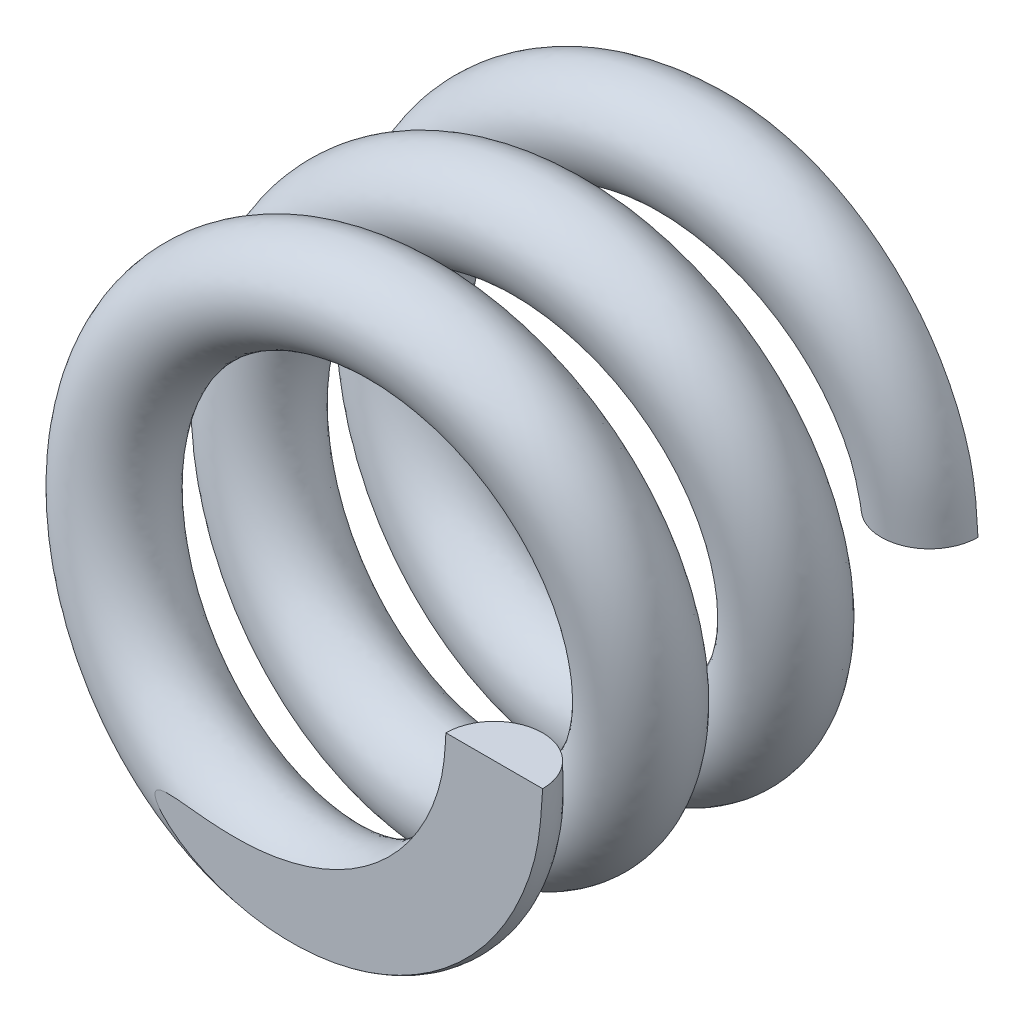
ISO-10303-21;
HEADER;
FILE_DESCRIPTION(('STEP AP214'),'2;1');
FILE_NAME('part.step','',(''),(''),'','','');
FILE_SCHEMA(('AUTOMOTIVE_DESIGN { 1 0 10303 214 1 1 1 1 }'));
ENDSEC;
DATA;
#1=APPLICATION_CONTEXT('core data for automotive mechanical design processes');
#2=APPLICATION_PROTOCOL_DEFINITION('international standard','automotive_design',2000,#1);
#3=PRODUCT_CONTEXT('',#1,'mechanical');
#4=PRODUCT('Part','Part','',(#3));
#5=PRODUCT_RELATED_PRODUCT_CATEGORY('part','',(#4));
#6=PRODUCT_DEFINITION_FORMATION('','',#4);
#7=PRODUCT_DEFINITION_CONTEXT('part definition',#1,'design');
#8=PRODUCT_DEFINITION('design','',#6,#7);
#9=PRODUCT_DEFINITION_SHAPE('','',#8);
#10=(LENGTH_UNIT() NAMED_UNIT(*) SI_UNIT(.MILLI.,.METRE.));
#11=(NAMED_UNIT(*) PLANE_ANGLE_UNIT() SI_UNIT($,.RADIAN.));
#12=(NAMED_UNIT(*) SI_UNIT($,.STERADIAN.) SOLID_ANGLE_UNIT());
#13=UNCERTAINTY_MEASURE_WITH_UNIT(LENGTH_MEASURE(1.E-05),#10,'distance_accuracy_value','');
#14=(GEOMETRIC_REPRESENTATION_CONTEXT(3) GLOBAL_UNCERTAINTY_ASSIGNED_CONTEXT((#13)) GLOBAL_UNIT_ASSIGNED_CONTEXT((#10,
#11,#12)) REPRESENTATION_CONTEXT('',''));
#15=CARTESIAN_POINT('',(0.,0.,0.));
#16=DIRECTION('',(0.,0.,1.));
#17=DIRECTION('',(1.,0.,0.));
#18=AXIS2_PLACEMENT_3D('',#15,#16,#17);
#19=CARTESIAN_POINT('',(14.,0.,-3.));
#20=DIRECTION('',(0.,-1.,0.));
#21=DIRECTION('',(0.,0.,-1.));
#22=AXIS2_PLACEMENT_3D('',#19,#20,#21);
#23=PLANE('',#22);
#24=CARTESIAN_POINT('',(14.,0.,0.));
#25=DIRECTION('',(0.,1.,0.));
#26=DIRECTION('',(0.,0.,1.));
#27=AXIS2_PLACEMENT_3D('',#24,#25,#26);
#28=CIRCLE('',#27,3.);
#29=CARTESIAN_POINT('',(16.9999999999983,-3.65540930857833E-11,0.));
#30=VERTEX_POINT('',#29);
#31=CARTESIAN_POINT('',(11.,0.,-1.17961196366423E-13));
#32=VERTEX_POINT('',#31);
#33=EDGE_CURVE('E67',#30,#32,#28,.T.);
#34=ORIENTED_EDGE('',*,*,#33,.T.);
#35=DIRECTION('',(1.,0.,0.));
#36=VECTOR('',#35,1.);
#37=CARTESIAN_POINT('',(14.,0.,0.));
#38=LINE('',#37,#36);
#39=EDGE_CURVE('E54',#32,#30,#38,.T.);
#40=ORIENTED_EDGE('',*,*,#39,.T.);
#41=EDGE_LOOP('',(#34,#40));
#42=FACE_BOUND('',#41,.T.);
#43=ADVANCED_FACE('F29',(#42),#23,.F.);
#44=CARTESIAN_POINT('',(13.9993308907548,-7.63502455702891E-09,-29.9999999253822));
#45=DIRECTION('',(2.28197236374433E-05,-0.99999999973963,-2.54481499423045E-09));
#46=DIRECTION('',(0.99999999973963,2.28197236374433E-05,0.));
#47=AXIS2_PLACEMENT_3D('',#44,#45,#46);
#48=PLANE('',#47);
#49=DIRECTION('',(-0.99999999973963,-2.28197236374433E-05,0.));
#50=VECTOR('',#49,1.);
#51=CARTESIAN_POINT('',(13.999330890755,-1.52694662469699E-08,-27.));
#52=LINE('',#51,#50);
#53=CARTESIAN_POINT('',(16.9999999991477,6.84606658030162E-05,-27.0000000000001));
#54=VERTEX_POINT('',#53);
#55=CARTESIAN_POINT('',(11.0000000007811,-6.84591714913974E-05,-27.0000000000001));
#56=VERTEX_POINT('',#55);
#57=EDGE_CURVE('E48',#54,#56,#52,.T.);
#58=ORIENTED_EDGE('',*,*,#57,.F.);
#59=CARTESIAN_POINT('',(14.,-5.82867087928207E-13,-27.));
#60=DIRECTION('',(2.28197236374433E-05,-0.99999999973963,-2.54481499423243E-09));
#61=DIRECTION('',(0.99999999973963,2.28197236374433E-05,0.));
#62=AXIS2_PLACEMENT_3D('',#59,#60,#61);
#63=CIRCLE('',#62,3.);
#64=EDGE_CURVE('E64',#54,#56,#63,.T.);
#65=ORIENTED_EDGE('',*,*,#64,.T.);
#66=EDGE_LOOP('',(#58,#65));
#67=FACE_BOUND('',#66,.T.);
#68=ADVANCED_FACE('F31',(#67),#48,.T.);
#69=CARTESIAN_POINT('',(14.,0.,3.));
#70=CARTESIAN_POINT('',(13.9470548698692,-0.914407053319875,2.90642996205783));
#71=CARTESIAN_POINT('',(13.840972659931,-2.74653629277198,2.71895065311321));
#72=CARTESIAN_POINT('',(13.0134819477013,-5.39186183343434,2.43760667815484));
#73=CARTESIAN_POINT('',(11.7172476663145,-7.82849346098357,2.1561755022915));
#74=CARTESIAN_POINT('',(9.96308010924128,-9.96404843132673,1.87497982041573));
#75=CARTESIAN_POINT('',(7.82716758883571,-11.7136182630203,1.59379278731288));
#76=CARTESIAN_POINT('',(5.39275309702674,-13.0195627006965,1.31248097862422));
#77=CARTESIAN_POINT('',(2.74865036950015,-13.817991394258,1.03125536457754));
#78=CARTESIAN_POINT('',(-0.000105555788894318,-14.0917480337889,0.749985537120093));
#79=CARTESIAN_POINT('',(-2.74841828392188,-13.8177373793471,0.468774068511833));
#80=CARTESIAN_POINT('',(-5.39287704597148,-13.0192561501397,0.18747539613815));
#81=CARTESIAN_POINT('',(-7.82704843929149,-11.7141789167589,-0.0937262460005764));
#82=CARTESIAN_POINT('',(-9.9645629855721,-9.96441308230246,-0.375025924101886));
#83=CARTESIAN_POINT('',(-11.7140663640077,-7.82720113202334,-0.656221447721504));
#84=CARTESIAN_POINT('',(-13.0192557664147,-5.39263774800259,-0.937530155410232));
#85=CARTESIAN_POINT('',(-13.8177581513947,-2.74861530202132,-1.21871866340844));
#86=CARTESIAN_POINT('',(-14.0918251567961,0.000100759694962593,-1.50003271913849));
#87=CARTESIAN_POINT('',(-13.8178464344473,2.7484537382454,-1.78121603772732));
#88=CARTESIAN_POINT('',(-13.0190276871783,5.39276133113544,-2.06253507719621));
#89=CARTESIAN_POINT('',(-11.7142996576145,7.82715029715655,-2.34371406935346));
#90=CARTESIAN_POINT('',(-9.96421494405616,9.96434090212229,-2.62503675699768));
#91=CARTESIAN_POINT('',(-7.82733044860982,11.7143010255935,-2.90621267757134));
#92=CARTESIAN_POINT('',(-5.39250052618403,13.0188609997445,-3.187537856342));
#93=CARTESIAN_POINT('',(-2.74865608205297,13.8181140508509,-3.46871190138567));
#94=CARTESIAN_POINT('',(7.30432679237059E-05,14.091324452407,-3.75003833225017));
#95=CARTESIAN_POINT('',(2.74857404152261,13.8182742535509,-4.03121174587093));
#96=CARTESIAN_POINT('',(5.39250980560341,13.0185040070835,-4.31253818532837));
#97=CARTESIAN_POINT('',(7.82747357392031,11.714712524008,-4.59371221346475));
#98=CARTESIAN_POINT('',(9.9638580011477,9.96378246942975,-4.87503741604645));
#99=CARTESIAN_POINT('',(11.7148208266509,7.8276253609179,-5.1562132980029));
#100=CARTESIAN_POINT('',(13.0181952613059,5.39226711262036,-5.4375360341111));
#101=CARTESIAN_POINT('',(13.8187729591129,2.74873912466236,-5.71871498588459));
#102=CARTESIAN_POINT('',(14.0905732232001,-3.07774829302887E-05,-6.00003405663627));
#103=CARTESIAN_POINT('',(13.8189723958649,-2.74876381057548,-6.28121725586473));
#104=CARTESIAN_POINT('',(13.0177931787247,-5.39216656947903,-6.56253150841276));
#105=CARTESIAN_POINT('',(11.7153269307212,-7.82794667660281,-6.84372007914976));
#106=CARTESIAN_POINT('',(9.96323972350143,-9.96324800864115,-7.1250284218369));
#107=CARTESIAN_POINT('',(7.82803544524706,-11.7155306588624,-7.40622341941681));
#108=CARTESIAN_POINT('',(5.39199434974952,-13.017407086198,-7.68752483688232));
#109=CARTESIAN_POINT('',(2.74885285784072,-13.81962156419,-7.96872723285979));
#110=CARTESIAN_POINT('',(2.04785708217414E-05,-14.0897325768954,-8.25002080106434));
#111=CARTESIAN_POINT('',(-2.74898887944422,-13.8198277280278,-8.53123146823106));
#112=CARTESIAN_POINT('',(-5.39179685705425,-13.0170375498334,-8.81251636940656));
#113=CARTESIAN_POINT('',(-7.82849228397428,-11.7160480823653,-9.09373606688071));
#114=CARTESIAN_POINT('',(-9.96262389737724,-9.96269056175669,-9.37501160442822));
#115=CARTESIAN_POINT('',(-11.7163191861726,-7.82850052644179,-9.65624096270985));
#116=CARTESIAN_POINT('',(-13.0166376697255,-5.39173289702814,-9.93750657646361));
#117=CARTESIAN_POINT('',(-13.8205295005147,-2.74898370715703,-10.2187460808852));
#118=CARTESIAN_POINT('',(-14.0889505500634,-7.19041500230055E-05,-10.5000013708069));
#119=CARTESIAN_POINT('',(-13.8207038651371,2.74920840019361,-10.7812513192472));
#120=CARTESIAN_POINT('',(-13.0163762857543,5.39147214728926,-11.0624961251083));
#121=CARTESIAN_POINT('',(-11.7167303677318,7.82899339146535,-11.3437564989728));
#122=CARTESIAN_POINT('',(-9.96224966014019,9.96212612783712,-11.624991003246));
#123=CARTESIAN_POINT('',(-7.82888997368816,11.716955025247,-11.9062615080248));
#124=CARTESIAN_POINT('',(-5.39154466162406,13.0160998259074,-12.1874861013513));
#125=CARTESIAN_POINT('',(-2.74908156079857,13.8211273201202,-12.4687662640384));
#126=CARTESIAN_POINT('',(-9.48044730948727E-05,14.088495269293,-12.7499814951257));
#127=CARTESIAN_POINT('',(2.74930614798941,13.8211315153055,-13.0312706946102));
#128=CARTESIAN_POINT('',(5.39133056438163,13.0160736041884,-13.3124772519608));
#129=CARTESIAN_POINT('',(7.82915142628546,11.7169567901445,-13.5937747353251));
#130=CARTESIAN_POINT('',(9.96196913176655,9.96210334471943,-13.8749734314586));
#131=CARTESIAN_POINT('',(11.7170586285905,7.82895983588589,-14.1562783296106));
#132=CARTESIAN_POINT('',(13.0160079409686,5.39150690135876,-14.4374700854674));
#133=CARTESIAN_POINT('',(13.8211118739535,2.74908485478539,-14.7187814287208));
#134=CARTESIAN_POINT('',(14.0885064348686,8.79699216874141E-05,-14.999967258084));
#135=CARTESIAN_POINT('',(13.8209940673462,-2.7492669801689,-15.2812839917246));
#136=CARTESIAN_POINT('',(13.0161762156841,-5.39138789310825,-15.5624649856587));
#137=CARTESIAN_POINT('',(11.7167506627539,-7.8289936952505,-15.8437859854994));
#138=CARTESIAN_POINT('',(9.96224254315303,-9.9621369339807,-16.1249632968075));
#139=CARTESIAN_POINT('',(7.82877515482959,-11.7167437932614,-16.4062873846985));
#140=CARTESIAN_POINT('',(5.3916019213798,-13.0163061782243,-16.6874622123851));
#141=CARTESIAN_POINT('',(2.74902066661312,-13.8206569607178,-16.9687881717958));
#142=CARTESIAN_POINT('',(5.59903001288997E-05,-14.0889073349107,-17.2499617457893));
#143=CARTESIAN_POINT('',(-2.7491318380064,-13.8204681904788,-17.5312883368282));
#144=CARTESIAN_POINT('',(-5.39160727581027,-13.0166089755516,-17.8124619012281));
#145=CARTESIAN_POINT('',(-7.82862394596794,-11.7162581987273,-18.0937878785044));
#146=CARTESIAN_POINT('',(-9.9625625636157,-9.9626093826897,-18.3749626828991));
#147=CARTESIAN_POINT('',(-11.7161599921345,-7.82843006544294,-18.6562867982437));
#148=CARTESIAN_POINT('',(-13.0169054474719,-5.39180098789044,-18.9374640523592));
#149=CARTESIAN_POINT('',(-13.8199339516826,-2.7489184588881,-19.2187851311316));
#150=CARTESIAN_POINT('',(-14.0896014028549,-7.35434338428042E-06,-19.4999661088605));
#151=CARTESIAN_POINT('',(-13.8197205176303,2.74893881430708,-19.7812827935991));
#152=CARTESIAN_POINT('',(-13.0172777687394,5.39193942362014,-20.0624683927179));
#153=CARTESIAN_POINT('',(-11.7156170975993,7.82813885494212,-20.343780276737));
#154=CARTESIAN_POINT('',(-9.96314343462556,9.96317175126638,-20.6249723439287));
#155=CARTESIAN_POINT('',(-7.82801043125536,11.7154478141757,-20.9062757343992));
#156=CARTESIAN_POINT('',(-5.39205945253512,13.0176694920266,-21.1874734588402));
#157=CARTESIAN_POINT('',(-2.748805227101,13.8190989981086,-21.4687762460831));
#158=CARTESIAN_POINT('',(3.81285597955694E-05,14.0905498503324,-21.7499833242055));
#159=CARTESIAN_POINT('',(2.74872811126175,13.818934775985,-22.0312577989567));
#160=CARTESIAN_POINT('',(5.39228580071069,13.0179282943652,-22.3124786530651));
#161=CARTESIAN_POINT('',(7.82775148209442,11.7147793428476,-22.5937952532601));
#162=CARTESIAN_POINT('',(9.96329013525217,9.96404394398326,-22.874977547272));
#163=CARTESIAN_POINT('',(11.7167178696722,7.82828344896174,-23.1561782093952));
#164=CARTESIAN_POINT('',(13.0125679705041,5.39126236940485,-23.4376036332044));
#165=CARTESIAN_POINT('',(13.8419906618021,2.74685717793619,-23.718953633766));
#166=CARTESIAN_POINT('',(13.9478398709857,0.914518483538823,-23.9064305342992));
#167=CARTESIAN_POINT('',(14.0006691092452,7.63385882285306E-09,-24.0000000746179));
#168=CARTESIAN_POINT('',(20.,0.,2.99999999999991));
#169=CARTESIAN_POINT('',(19.9245934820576,-1.30708909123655,2.90656525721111));
#170=CARTESIAN_POINT('',(19.7735070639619,-3.92600605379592,2.71935702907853));
#171=CARTESIAN_POINT('',(18.5917812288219,-7.69748940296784,2.4358561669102));
#172=CARTESIAN_POINT('',(16.7392217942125,-11.1841263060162,2.15495574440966));
#173=CARTESIAN_POINT('',(14.229157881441,-14.2372317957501,1.87444479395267));
#174=CARTESIAN_POINT('',(11.1852758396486,-16.7324958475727,1.59443024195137));
#175=CARTESIAN_POINT('',(7.70087103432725,-18.5997139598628,1.31010517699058));
#176=CARTESIAN_POINT('',(3.9300257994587,-19.7401020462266,1.03154853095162));
#177=CARTESIAN_POINT('',(-0.0049040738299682,-20.130313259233,0.748094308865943));
#178=CARTESIAN_POINT('',(-3.92195961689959,-19.7413640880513,0.469543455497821));
#179=CARTESIAN_POINT('',(-7.70878711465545,-18.5961188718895,0.184999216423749));
#180=CARTESIAN_POINT('',(-11.1775923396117,-16.7381552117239,-0.0927741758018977));
#181=CARTESIAN_POINT('',(-14.2388876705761,-14.2299737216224,-0.377609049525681));
#182=CARTESIAN_POINT('',(-16.7317525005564,-11.1871381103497,-0.655044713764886));
#183=CARTESIAN_POINT('',(-18.6008081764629,-7.69725905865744,-0.940329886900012));
#184=CARTESIAN_POINT('',(-19.7391628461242,-3.93317858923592,-1.21736147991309));
#185=CARTESIAN_POINT('',(-20.1304573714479,0.00733428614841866,-1.50296443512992));
#186=CARTESIAN_POINT('',(-19.7419093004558,3.91959718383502,-1.77970613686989));
#187=CARTESIAN_POINT('',(-18.5951093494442,7.71064243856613,-2.06557353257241));
#188=CARTESIAN_POINT('',(-16.7394522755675,11.1758533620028,-2.34208265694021));
#189=CARTESIAN_POINT('',(-14.2286831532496,14.2398173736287,-2.62814147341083));
#190=CARTESIAN_POINT('',(-11.188707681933,16.7309719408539,-2.90449198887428));
#191=CARTESIAN_POINT('',(-7.69611480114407,18.6008747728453,-3.19067329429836));
#192=CARTESIAN_POINT('',(-3.93454445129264,19.7392106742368,-3.46693495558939));
#193=CARTESIAN_POINT('',(0.00793901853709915,20.1299983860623,-3.75316890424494));
#194=CARTESIAN_POINT('',(3.91878748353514,19.7424779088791,-4.02941259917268));
#195=CARTESIAN_POINT('',(7.71056394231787,18.5945597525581,-4.31562942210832));
#196=CARTESIAN_POINT('',(11.1757311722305,16.7401111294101,-4.59192582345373));
#197=CARTESIAN_POINT('',(14.2391660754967,14.228479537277,-4.87805575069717));
#198=CARTESIAN_POINT('',(16.7314216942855,11.1890309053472,-5.15447553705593));
#199=CARTESIAN_POINT('',(18.5999735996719,7.6965626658,-5.44044886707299));
#200=CARTESIAN_POINT('',(19.7399053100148,3.93423251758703,-5.71706260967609));
#201=CARTESIAN_POINT('',(20.1292907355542,-0.00675104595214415,-6.00280976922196));
#202=CARTESIAN_POINT('',(19.7429670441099,-3.91981546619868,-6.27968788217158));
#203=CARTESIAN_POINT('',(18.594486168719,-7.70879698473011,-6.56513948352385));
#204=CARTESIAN_POINT('',(16.7399454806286,-11.1772981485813,-6.84235216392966));
#205=CARTESIAN_POINT('',(14.2293537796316,-14.2372015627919,-7.12743906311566));
#206=CARTESIAN_POINT('',(11.1878936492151,-16.7331170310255,-7.40505623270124));
#207=CARTESIAN_POINT('',(7.69847529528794,-18.5983282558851,-7.6897095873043));
#208=CARTESIAN_POINT('',(3.93204727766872,-19.7411708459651,-7.96780083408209));
#209=CARTESIAN_POINT('',(-0.00397891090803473,-20.1284946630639,-8.2519521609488));
#210=CARTESIAN_POINT('',(-3.92282695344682,-19.743228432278,-8.53058668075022));
#211=CARTESIAN_POINT('',(-7.70559797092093,-18.5949508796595,-8.81416791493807));
#212=CARTESIAN_POINT('',(-11.1806258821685,-16.7387616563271,-9.09341444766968));
#213=CARTESIAN_POINT('',(-14.2341858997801,-14.2312595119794,-9.37635802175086));
#214=CARTESIAN_POINT('',(-16.73604350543,-11.1850916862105,-9.65628471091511));
#215=CARTESIAN_POINT('',(-18.596161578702,-7.70170274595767,-9.93852392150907));
#216=CARTESIAN_POINT('',(-19.7429114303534,-3.92781314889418,-10.2191971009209));
#217=CARTESIAN_POINT('',(-20.1277520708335,-0.000135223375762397,-10.5006704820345));
#218=CARTESIAN_POINT('',(-19.743114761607,3.92789199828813,-10.7821385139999));
#219=CARTESIAN_POINT('',(-18.5959487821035,7.70132487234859,-11.062817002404));
#220=CARTESIAN_POINT('',(-16.736537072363,11.1854610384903,-11.3450509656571));
#221=CARTESIAN_POINT('',(-14.2339016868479,14.2306052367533,-11.6249828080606));
#222=CARTESIAN_POINT('',(-11.1811465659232,16.7395861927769,-11.9079213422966));
#223=CARTESIAN_POINT('',(-7.70546386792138,18.5939644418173,-12.1871727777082));
#224=CARTESIAN_POINT('',(-3.92306420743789,19.7444990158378,-12.4707492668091));
#225=CARTESIAN_POINT('',(-0.00422266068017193,20.1272575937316,-12.7493883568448));
#226=CARTESIAN_POINT('',(3.93235662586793,19.7427091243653,-13.0335353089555));
#227=CARTESIAN_POINT('',(7.69769213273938,18.5970445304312,-13.3116307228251));
#228=CARTESIAN_POINT('',(11.1888882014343,16.7346238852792,-13.5962801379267));
#229=CARTESIAN_POINT('',(14.2279912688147,14.2361492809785,-13.8739010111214));
#230=CARTESIAN_POINT('',(16.7415964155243,11.1784314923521,-14.158984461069));
#231=CARTESIAN_POINT('',(18.5926509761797,7.70825886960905,-14.4362003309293));
#232=CARTESIAN_POINT('',(19.7450780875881,3.92027735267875,-14.7216490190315));
#233=CARTESIAN_POINT('',(20.1272243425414,0.00694084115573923,-14.9985297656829));
#234=CARTESIAN_POINT('',(19.7421537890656,-3.93462054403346,-15.2842745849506));
#235=CARTESIAN_POINT('',(18.5980061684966,-7.69555993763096,-15.5608903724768));
#236=CARTESIAN_POINT('',(16.7334296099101,-11.1902815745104,-15.8468619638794));
#237=CARTESIAN_POINT('',(14.237646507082,-14.2267387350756,-16.1232831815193));
#238=CARTESIAN_POINT('',(11.1771488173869,-16.742064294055,-16.4094119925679));
#239=CARTESIAN_POINT('',(7.70978235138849,-18.5923101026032,-16.6857091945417));
#240=CARTESIAN_POINT('',(3.91936990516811,-19.7448331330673,-16.9719255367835));
#241=CARTESIAN_POINT('',(0.0080598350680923,-20.1275817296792,-17.2481693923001));
#242=CARTESIAN_POINT('',(-3.93488556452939,-19.7415911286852,-17.5344035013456));
#243=CARTESIAN_POINT('',(-7.6950931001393,-18.598676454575,-17.8106646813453));
#244=CARTESIAN_POINT('',(-11.189887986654,-16.7330042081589,-18.096846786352));
#245=CARTESIAN_POINT('',(-14.2269317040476,-14.2381855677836,-18.3731961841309));
#246=CARTESIAN_POINT('',(-16.7412375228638,-11.1772447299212,-18.659256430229));
#247=CARTESIAN_POINT('',(-18.5929332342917,-7.70981332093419,-18.9357638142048));
#248=CARTESIAN_POINT('',(-19.743970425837,-3.92019248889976,-19.2216332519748));
#249=CARTESIAN_POINT('',(-20.1282340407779,-0.00738397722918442,-19.4983726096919));
#250=CARTESIAN_POINT('',(-19.7411505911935,3.93337256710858,-19.7839781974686));
#251=CARTESIAN_POINT('',(-18.5988857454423,7.69642762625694,-20.0610068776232));
#252=CARTESIAN_POINT('',(-16.7333756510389,11.1879668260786,-20.346295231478));
#253=CARTESIAN_POINT('',(-14.2375711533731,14.2286298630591,-20.6237274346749));
#254=CARTESIAN_POINT('',(-11.1786620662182,16.7393517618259,-20.9085660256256));
#255=CARTESIAN_POINT('',(-7.70810472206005,18.5944765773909,-21.1863354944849));
#256=CARTESIAN_POINT('',(-3.92247302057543,19.7427002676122,-21.4708838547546));
#257=CARTESIAN_POINT('',(-0.00490758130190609,20.1291153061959,-21.7494303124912));
#258=CARTESIAN_POINT('',(3.92997814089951,19.7410701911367,-22.0328891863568));
#259=CARTESIAN_POINT('',(7.7002672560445,18.5981364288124,-22.3114410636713));
#260=CARTESIAN_POINT('',(11.1857532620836,16.7337278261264,-22.5957709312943));
#261=CARTESIAN_POINT('',(14.2292637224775,14.2373313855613,-22.8757807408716));
#262=CARTESIAN_POINT('',(16.7386214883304,11.1840218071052,-23.1562966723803));
#263=CARTESIAN_POINT('',(18.5908098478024,7.69702927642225,-23.4371913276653));
#264=CARTESIAN_POINT('',(19.774500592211,3.92645050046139,-23.7206982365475));
#265=CARTESIAN_POINT('',(19.9253701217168,1.30733496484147,-23.9079040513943));
#266=CARTESIAN_POINT('',(20.0006689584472,0.000136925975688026,-24.0013382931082));
#267=CARTESIAN_POINT('',(20.,0.,-3.00000000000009));
#268=CARTESIAN_POINT('',(19.9247100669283,-1.30716126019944,-3.09343475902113));
#269=CARTESIAN_POINT('',(19.773857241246,-3.92622282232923,-3.28064301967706));
#270=CARTESIAN_POINT('',(18.5902568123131,-7.69660503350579,-3.56414363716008));
#271=CARTESIAN_POINT('',(16.7381181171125,-11.1835633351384,-3.84504412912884));
#272=CARTESIAN_POINT('',(14.2289076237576,-14.2367350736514,-4.12555519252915));
#273=CARTESIAN_POINT('',(11.1854661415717,-16.7331099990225,-4.40556983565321));
#274=CARTESIAN_POINT('',(7.70016791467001,-18.597448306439,-4.68989452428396));
#275=CARTESIAN_POINT('',(3.92994905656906,-19.7403896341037,-4.96845156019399));
#276=CARTESIAN_POINT('',(-0.00473800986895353,-20.1284414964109,-5.2519054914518));
#277=CARTESIAN_POINT('',(-3.92223580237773,-19.7420612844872,-5.53045666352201));
#278=CARTESIAN_POINT('',(-7.70769315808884,-18.5939176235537,-5.81500048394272));
#279=CARTESIAN_POINT('',(-11.1781962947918,-16.7388536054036,-6.09277432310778));
#280=CARTESIAN_POINT('',(-14.2369789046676,-14.2282689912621,-6.37760873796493));
#281=CARTESIAN_POINT('',(-16.7327527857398,-11.1876878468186,-6.6550448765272));
#282=CARTESIAN_POINT('',(-18.5982018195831,-7.69631748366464,-6.94032954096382));
#283=CARTESIAN_POINT('',(-19.740467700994,-3.93335680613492,-7.21736165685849));
#284=CARTESIAN_POINT('',(-20.1275599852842,0.00722775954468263,-7.50296407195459));
#285=CARTESIAN_POINT('',(-19.7433343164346,3.91994177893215,-7.7797063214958));
#286=CARTESIAN_POINT('',(-18.5923686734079,7.70941481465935,-8.06557315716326));
#287=CARTESIAN_POINT('',(-16.7407481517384,11.1767661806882,-8.34208284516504));
#288=CARTESIAN_POINT('',(-14.226559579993,14.2376043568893,-8.62814109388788));
#289=CARTESIAN_POINT('',(-11.1896226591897,16.7323723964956,-8.90449217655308));
#290=CARTESIAN_POINT('',(-7.69496762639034,18.5979987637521,-9.19067291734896));
#291=CARTESIAN_POINT('',(-3.93488661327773,19.7409050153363,-9.46693513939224));
#292=CARTESIAN_POINT('',(0.007920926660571,20.1269076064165,-9.75316853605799));
#293=CARTESIAN_POINT('',(3.91910194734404,19.7442005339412,-10.0294127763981));
#294=CARTESIAN_POINT('',(7.70940023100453,18.5917387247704,-10.3156290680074));
#295=CARTESIAN_POINT('',(11.1766554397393,16.7415848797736,-10.5919259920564));
#296=CARTESIAN_POINT('',(14.2370780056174,14.2263539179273,-10.8780554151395));
#297=CARTESIAN_POINT('',(16.732787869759,11.190031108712,-11.1544756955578));
#298=CARTESIAN_POINT('',(18.5973353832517,7.69541792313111,-11.4404485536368));
#299=CARTESIAN_POINT('',(19.7414641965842,3.93463888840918,-11.717062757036));
#300=CARTESIAN_POINT('',(20.1265503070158,-0.00681957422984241,-12.0028094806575));
#301=CARTESIAN_POINT('',(19.7444487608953,-3.91999254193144,-12.2796880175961));
#302=CARTESIAN_POINT('',(18.5920731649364,-7.70789260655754,-12.5651392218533));
#303=CARTESIAN_POINT('',(16.7411260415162,-11.1779243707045,-12.8423522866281));
#304=CARTESIAN_POINT('',(14.2275950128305,-14.235592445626,-13.1274388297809));
#305=CARTESIAN_POINT('',(11.188650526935,-16.7339734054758,-13.4050563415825));
#306=CARTESIAN_POINT('',(7.69753604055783,-18.5963797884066,-13.6897093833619));
#307=CARTESIAN_POINT('',(3.93238894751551,-19.7420165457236,-13.967800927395));
#308=CARTESIAN_POINT('',(-0.00411545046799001,-20.126583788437,-14.2519519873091));
#309=CARTESIAN_POINT('',(-3.92276674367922,-19.7438719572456,-14.5305867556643));
#310=CARTESIAN_POINT('',(-7.7051093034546,-18.5933820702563,-14.8141677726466));
#311=CARTESIAN_POINT('',(-11.1806299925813,-16.7391217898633,-15.0934144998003));
#312=CARTESIAN_POINT('',(-14.2333527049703,-14.2302015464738,-15.376357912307));
#313=CARTESIAN_POINT('',(-16.735881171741,-11.185230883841,-15.6562847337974));
#314=CARTESIAN_POINT('',(-18.5952877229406,-7.70116075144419,-15.9385238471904));
#315=CARTESIAN_POINT('',(-19.7424204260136,-3.92793121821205,-16.2191970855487));
#316=CARTESIAN_POINT('',(-20.1270786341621,3.45427371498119E-05,-16.500670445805));
#317=CARTESIAN_POINT('',(-19.7422848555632,3.92751102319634,-16.7821384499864));
#318=CARTESIAN_POINT('',(-18.5955781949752,7.70135167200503,-17.0628170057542));
#319=CARTESIAN_POINT('',(-16.7355798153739,11.1845732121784,-17.3450508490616));
#320=CARTESIAN_POINT('',(-14.2337821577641,14.2307111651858,-17.6249828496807));
#321=CARTESIAN_POINT('',(-11.1803947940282,16.7381058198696,-17.907921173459));
#322=CARTESIAN_POINT('',(-7.70543646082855,18.5942891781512,-18.1871728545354));
#323=CARTESIAN_POINT('',(-3.92286259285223,19.7425343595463,-18.4707490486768));
#324=CARTESIAN_POINT('',(-0.0040852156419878,20.127821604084,-18.7493884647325));
#325=CARTESIAN_POINT('',(3.93175107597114,19.7405427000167,-19.0335350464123));
#326=CARTESIAN_POINT('',(7.69811697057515,18.5977482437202,-19.3116308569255));
#327=CARTESIAN_POINT('',(11.1873819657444,16.7326483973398,-19.5962798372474));
#328=CARTESIAN_POINT('',(14.228798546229,14.2368051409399,-19.8739011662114));
#329=CARTESIAN_POINT('',(16.7392951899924,11.1770582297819,-20.158984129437));
#330=CARTESIAN_POINT('',(18.5938201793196,7.70864654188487,-20.4362005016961));
#331=CARTESIAN_POINT('',(19.7422751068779,3.91983907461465,-20.7216486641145));
#332=CARTESIAN_POINT('',(20.1286179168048,0.00687079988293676,-20.9985299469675));
#333=CARTESIAN_POINT('',(19.7392742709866,-3.93394977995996,-21.2842742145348));
#334=CARTESIAN_POINT('',(18.599399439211,-7.69619075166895,-21.5608905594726));
#335=CARTESIAN_POINT('',(16.7309445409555,-11.1885316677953,-21.8468615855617));
#336=CARTESIAN_POINT('',(14.2387810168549,-14.2279131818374,-22.1232833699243));
#337=CARTESIAN_POINT('',(11.1754777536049,-16.7394697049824,-22.4094116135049));
#338=CARTESIAN_POINT('',(7.71042903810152,-18.5938874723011,-22.6857093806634));
#339=CARTESIAN_POINT('',(3.91879442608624,-19.741789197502,-22.971925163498));
#340=CARTESIAN_POINT('',(0.00807615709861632,-20.1293256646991,-23.248169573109));
#341=CARTESIAN_POINT('',(-3.93427892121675,-19.7385761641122,-23.5344031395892));
#342=CARTESIAN_POINT('',(-7.69572649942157,-18.6003074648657,-23.8106648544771));
#343=CARTESIAN_POINT('',(-11.1882233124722,-16.730484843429,-24.0968464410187));
#344=CARTESIAN_POINT('',(-14.2281041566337,-14.2394449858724,-24.3731963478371));
#345=CARTESIAN_POINT('',(-16.738820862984,-11.1755850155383,-24.6592561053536));
#346=CARTESIAN_POINT('',(-18.594430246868,-7.71052395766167,-24.9357639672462));
#347=CARTESIAN_POINT('',(-19.7412241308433,-3.91958667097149,-25.2216329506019));
#348=CARTESIAN_POINT('',(-20.1297845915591,-0.00748887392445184,-25.4983727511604));
#349=CARTESIAN_POINT('',(-19.7385250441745,3.93293016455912,-25.7839779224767));
#350=CARTESIAN_POINT('',(-18.6002472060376,7.69685520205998,-26.0610070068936));
#351=CARTESIAN_POINT('',(-16.7312562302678,11.1866677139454,-26.3462949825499));
#352=CARTESIAN_POINT('',(-14.2385265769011,14.2293832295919,-26.6237275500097));
#353=CARTESIAN_POINT('',(-11.1773108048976,16.737532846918,-26.9085658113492));
#354=CARTESIAN_POINT('',(-7.70868213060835,18.5954339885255,-27.1863355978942));
#355=CARTESIAN_POINT('',(-3.92193507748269,19.7406818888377,-27.4708836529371));
#356=CARTESIAN_POINT('',(-0.00507255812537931,20.1296402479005,-27.7494303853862));
#357=CARTESIAN_POINT('',(3.92979140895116,19.7394617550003,-28.0328890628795));
#358=CARTESIAN_POINT('',(7.70045559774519,18.599157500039,-28.3114411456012));
#359=CARTESIAN_POINT('',(11.1848139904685,16.731994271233,-28.5957707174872));
#360=CARTESIAN_POINT('',(14.2285624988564,14.2368750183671,-28.875780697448));
#361=CARTESIAN_POINT('',(16.7386050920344,11.1838363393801,-29.1562966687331));
#362=CARTESIAN_POINT('',(18.5910901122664,7.69739939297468,-29.437191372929));
#363=CARTESIAN_POINT('',(19.7728272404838,3.92597065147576,-29.7206980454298));
#364=CARTESIAN_POINT('',(19.9239203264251,1.30717519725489,-29.9079038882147));
#365=CARTESIAN_POINT('',(19.9993307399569,0.000136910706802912,-30.0013381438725));
#366=CARTESIAN_POINT('',(14.,0.,-3.));
#367=CARTESIAN_POINT('',(13.9471714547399,-0.914479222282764,-3.09357005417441));
#368=CARTESIAN_POINT('',(13.8413228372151,-2.74675306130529,-3.28104939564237));
#369=CARTESIAN_POINT('',(13.0119575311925,-5.3909774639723,-3.56239312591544));
#370=CARTESIAN_POINT('',(11.7161439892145,-7.82793049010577,-3.84382437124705));
#371=CARTESIAN_POINT('',(9.9628298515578,-9.96355170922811,-4.12502016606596));
#372=CARTESIAN_POINT('',(7.82735789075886,-11.7142324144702,-4.40620729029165));
#373=CARTESIAN_POINT('',(5.39204997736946,-13.0172970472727,-4.68751872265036));
#374=CARTESIAN_POINT('',(2.74857362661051,-13.8182789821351,-4.96874472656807));
#375=CARTESIAN_POINT('',(6.05081721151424E-05,-14.0898762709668,-5.2500142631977));
#376=CARTESIAN_POINT('',(-2.7486944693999,-13.8184345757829,-5.53122605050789));
#377=CARTESIAN_POINT('',(-5.39178308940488,-13.0170549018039,-5.81252430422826));
#378=CARTESIAN_POINT('',(-7.82765239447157,-11.7148773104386,-6.09372639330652));
#379=CARTESIAN_POINT('',(-9.96265421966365,-9.96270835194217,-6.37502561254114));
#380=CARTESIAN_POINT('',(-11.7150666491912,-7.82775086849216,-6.65622161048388));
#381=CARTESIAN_POINT('',(-13.0166494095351,-5.39169617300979,-6.9375298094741));
#382=CARTESIAN_POINT('',(-13.8190630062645,-2.74879351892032,-7.21871884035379));
#383=CARTESIAN_POINT('',(-14.0889277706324,-5.76690877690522E-06,-7.5000323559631));
#384=CARTESIAN_POINT('',(-13.8192714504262,2.74879833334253,-7.78121622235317));
#385=CARTESIAN_POINT('',(-13.0162870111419,5.39153370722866,-8.06253470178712));
#386=CARTESIAN_POINT('',(-11.7155955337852,7.82806311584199,-8.34371425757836));
#387=CARTESIAN_POINT('',(-9.96209137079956,9.96212788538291,-8.62503637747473));
#388=CARTESIAN_POINT('',(-7.82824542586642,11.7157014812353,-8.90621286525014));
#389=CARTESIAN_POINT('',(-5.39135335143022,13.0159849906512,-9.18753747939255));
#390=CARTESIAN_POINT('',(-2.74899824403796,13.8198083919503,-9.4687120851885));
#391=CARTESIAN_POINT('',(5.49513914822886E-05,14.0882336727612,-9.75003796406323));
#392=CARTESIAN_POINT('',(2.7488885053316,13.819996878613,-10.0312119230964));
#393=CARTESIAN_POINT('',(5.39134609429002,13.0156829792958,-10.3125378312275));
#394=CARTESIAN_POINT('',(7.82839784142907,11.7161862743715,-10.5937123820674));
#395=CARTESIAN_POINT('',(9.96176993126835,9.96165685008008,-10.8750370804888));
#396=CARTESIAN_POINT('',(11.7161870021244,7.82862556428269,-11.1562134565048));
#397=CARTESIAN_POINT('',(13.0155570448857,5.39112236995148,-11.4375357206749));
#398=CARTESIAN_POINT('',(13.8203318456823,2.74914549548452,-11.7187151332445));
#399=CARTESIAN_POINT('',(14.0878327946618,-9.93057606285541E-05,-12.0000337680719));
#400=CARTESIAN_POINT('',(13.8204541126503,-2.74894088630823,-12.2812173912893));
#401=CARTESIAN_POINT('',(13.0153801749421,-5.39126219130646,-12.5625312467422));
#402=CARTESIAN_POINT('',(11.7165074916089,-7.82857289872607,-12.8437202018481));
#403=CARTESIAN_POINT('',(9.96148095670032,-9.96163889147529,-13.1250281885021));
#404=CARTESIAN_POINT('',(7.82879232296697,-11.7163870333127,-13.4062235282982));
#405=CARTESIAN_POINT('',(5.39105509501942,-13.0154586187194,-13.6875246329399));
#406=CARTESIAN_POINT('',(2.7491945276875,-13.8204672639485,-13.9687273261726));
#407=CARTESIAN_POINT('',(-0.000116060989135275,-14.0878217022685,-14.2500206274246));
#408=CARTESIAN_POINT('',(-2.74892866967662,-13.8204712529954,-14.5312315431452));
#409=CARTESIAN_POINT('',(-5.39130818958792,-13.0154687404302,-14.812516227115));
#410=CARTESIAN_POINT('',(-7.82849639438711,-11.7164082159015,-15.0937361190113));
#411=CARTESIAN_POINT('',(-9.96179070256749,-9.96163259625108,-15.3750114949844));
#412=CARTESIAN_POINT('',(-11.7161568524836,-7.82863972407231,-15.6562409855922));
#413=CARTESIAN_POINT('',(-13.0157638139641,-5.39119090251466,-15.9375065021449));
#414=CARTESIAN_POINT('',(-13.8200384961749,-2.7491017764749,-16.218746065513));
#415=CARTESIAN_POINT('',(-14.0882771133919,9.78619628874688E-05,-16.5000013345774));
#416=CARTESIAN_POINT('',(-13.8198739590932,2.74882742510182,-16.7812512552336));
#417=CARTESIAN_POINT('',(-13.0160056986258,5.39149894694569,-17.0624961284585));
#418=CARTESIAN_POINT('',(-11.7157731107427,7.82810556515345,-17.3437563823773));
#419=CARTESIAN_POINT('',(-9.96213013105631,9.96223205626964,-17.6249910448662));
#420=CARTESIAN_POINT('',(-7.82813820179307,11.7154746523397,-17.9062613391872));
#421=CARTESIAN_POINT('',(-5.39151725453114,13.0164245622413,-18.1874861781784));
#422=CARTESIAN_POINT('',(-2.74887994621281,13.8191626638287,-18.4687660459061));
#423=CARTESIAN_POINT('',(4.26405651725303E-05,14.0890592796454,-18.7499816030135));
#424=CARTESIAN_POINT('',(2.7487005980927,13.818965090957,-19.031270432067));
#425=CARTESIAN_POINT('',(5.3917554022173,13.0167773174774,-19.3124773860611));
#426=CARTESIAN_POINT('',(7.82764519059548,11.7149813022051,-19.5937744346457));
#427=CARTESIAN_POINT('',(9.96277640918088,9.96275920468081,-19.8749735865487));
#428=CARTESIAN_POINT('',(11.7147574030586,7.82758657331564,-20.1562779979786));
#429=CARTESIAN_POINT('',(13.0171771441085,5.39189457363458,-20.4374702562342));
#430=CARTESIAN_POINT('',(13.8183088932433,2.7486465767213,-20.7187810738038));
#431=CARTESIAN_POINT('',(14.089900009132,1.79286488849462E-05,-20.9999674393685));
#432=CARTESIAN_POINT('',(13.8181145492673,-2.7485962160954,-21.2812836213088));
#433=CARTESIAN_POINT('',(13.0175694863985,-5.39201870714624,-21.5624651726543));
#434=CARTESIAN_POINT('',(11.7142655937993,-7.82724378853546,-21.8437856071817));
#435=CARTESIAN_POINT('',(9.96337705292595,-9.96331138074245,-22.1249634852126));
#436=CARTESIAN_POINT('',(7.82710409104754,-11.7141492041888,-22.4062870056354));
#437=CARTESIAN_POINT('',(5.39224860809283,-13.0178835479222,-22.6874623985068));
#438=CARTESIAN_POINT('',(2.74844518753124,-13.8176130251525,-22.9687877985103));
#439=CARTESIAN_POINT('',(7.23123305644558E-05,-14.0906512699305,-23.2499619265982));
#440=CARTESIAN_POINT('',(-2.74852519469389,-13.8174532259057,-23.5312879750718));
#441=CARTESIAN_POINT('',(-5.39224067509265,-13.0182399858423,-23.8124620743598));
#442=CARTESIAN_POINT('',(-7.82695927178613,-11.7137388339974,-24.0937875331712));
#443=CARTESIAN_POINT('',(-9.9637350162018,-9.96386880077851,-24.3749628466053));
#444=CARTESIAN_POINT('',(-11.7137433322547,-7.82677035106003,-24.6562864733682));
#445=CARTESIAN_POINT('',(-13.0184024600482,-5.39251162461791,-24.9374642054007));
#446=CARTESIAN_POINT('',(-13.8171876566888,-2.74831264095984,-25.2187848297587));
#447=CARTESIAN_POINT('',(-14.0911519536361,-0.000112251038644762,-25.499966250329));
#448=CARTESIAN_POINT('',(-13.8170949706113,2.74849641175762,-25.7812825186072));
#449=CARTESIAN_POINT('',(-13.0186392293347,5.39236699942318,-26.0624685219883));
#450=CARTESIAN_POINT('',(-11.7134976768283,7.82683974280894,-26.3437800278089));
#451=CARTESIAN_POINT('',(-9.96409885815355,9.96392511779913,-26.6249724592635));
#452=CARTESIAN_POINT('',(-7.82665916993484,11.7136288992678,-26.9062755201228));
#453=CARTESIAN_POINT('',(-5.39263686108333,13.0186269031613,-27.1874735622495));
#454=CARTESIAN_POINT('',(-2.74826728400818,13.8170806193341,-27.4687760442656));
#455=CARTESIAN_POINT('',(-0.000126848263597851,14.0910747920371,-27.7499833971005));
#456=CARTESIAN_POINT('',(2.74854137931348,13.8173263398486,-28.0312576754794));
#457=CARTESIAN_POINT('',(5.39247414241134,13.0189493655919,-28.312478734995));
#458=CARTESIAN_POINT('',(7.8268122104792,11.7130457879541,-28.593795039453));
#459=CARTESIAN_POINT('',(9.96258891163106,9.96358757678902,-28.8749775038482));
#460=CARTESIAN_POINT('',(11.7167014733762,7.82809798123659,-29.156178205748));
#461=CARTESIAN_POINT('',(13.0128482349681,5.39163248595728,-29.4376036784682));
#462=CARTESIAN_POINT('',(13.8403173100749,2.74637732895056,-29.7189534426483));
#463=CARTESIAN_POINT('',(13.9463900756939,0.914358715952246,-29.9064303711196));
#464=CARTESIAN_POINT('',(13.9993308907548,-7.63502455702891E-09,-29.9999999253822));
#465=CARTESIAN_POINT('',(8.,0.,-3.00000000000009));
#466=CARTESIAN_POINT('',(7.96963284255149,-0.521797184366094,-3.09370534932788));
#467=CARTESIAN_POINT('',(7.90878843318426,-1.56728330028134,-3.28145577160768));
#468=CARTESIAN_POINT('',(7.43365825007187,-3.0853498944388,-3.5606426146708));
#469=CARTESIAN_POINT('',(6.69416986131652,-4.47229764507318,-3.84260461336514));
#470=CARTESIAN_POINT('',(5.69675207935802,-5.69036834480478,-4.12448513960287));
#471=CARTESIAN_POINT('',(4.469249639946,-6.69535482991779,-4.40684474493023));
#472=CARTESIAN_POINT('',(3.08393204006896,-7.43714578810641,-4.68514292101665));
#473=CARTESIAN_POINT('',(1.56719819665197,-7.89616833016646,-4.96903789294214));
#474=CARTESIAN_POINT('',(0.00485902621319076,-8.05131104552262,-5.24812303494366));
#475=CARTESIAN_POINT('',(-1.57515313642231,-7.89480786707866,-5.53199543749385));
#476=CARTESIAN_POINT('',(-3.07587302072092,-7.44019218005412,-5.81004812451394));
#477=CARTESIAN_POINT('',(-4.47710849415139,-6.69090101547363,-6.09467846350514));
#478=CARTESIAN_POINT('',(-5.68832953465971,-5.69714771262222,-6.37244248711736));
#479=CARTESIAN_POINT('',(-6.69738051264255,-4.46781389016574,-6.65739834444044));
#480=CARTESIAN_POINT('',(-7.4350969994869,-3.08707486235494,-6.93473007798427));
#481=CARTESIAN_POINT('',(-7.89765831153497,-1.56423023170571,-7.22007602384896));
#482=CARTESIAN_POINT('',(-8.05029555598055,-0.00723929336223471,-7.4971006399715));
#483=CARTESIAN_POINT('',(-7.89520858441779,1.57765488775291,-7.78272612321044));
#484=CARTESIAN_POINT('',(-7.44020534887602,3.07365259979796,-8.05949624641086));
#485=CARTESIAN_POINT('',(-6.69044291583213,4.47936005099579,-8.34534566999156));
#486=CARTESIAN_POINT('',(-5.69762316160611,5.68665141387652,-8.6219316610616));
#487=CARTESIAN_POINT('',(-4.46686819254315,6.69903056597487,-8.9079335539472));
#488=CARTESIAN_POINT('',(-3.0877390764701,7.43397121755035,-9.18440204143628));
#489=CARTESIAN_POINT('',(-1.56310987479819,7.89871176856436,-9.47048903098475));
#490=CARTESIAN_POINT('',(-0.00781102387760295,8.04955973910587,-9.74690739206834));
#491=CARTESIAN_POINT('',(1.57867506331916,7.89579322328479,-10.0330110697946));
#492=CARTESIAN_POINT('',(3.07329195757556,7.43962723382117,-10.3094465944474));
#493=CARTESIAN_POINT('',(4.48014024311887,6.69078766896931,-10.5954987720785));
#494=CARTESIAN_POINT('',(5.68646185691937,5.69695978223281,-10.8720187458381));
#495=CARTESIAN_POINT('',(6.69958613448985,4.46722001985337,-11.1579512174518));
#496=CARTESIAN_POINT('',(7.43377870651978,3.08682681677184,-11.4346228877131));
#497=CARTESIAN_POINT('',(7.89919949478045,1.56365210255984,-11.7203675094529));
#498=CARTESIAN_POINT('',(8.04911528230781,0.00662096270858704,-11.9972580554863));
#499=CARTESIAN_POINT('',(7.89645946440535,-1.57788923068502,-12.2827467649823));
#500=CARTESIAN_POINT('',(7.4386871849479,-3.07463177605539,-12.559923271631));
#501=CARTESIAN_POINT('',(6.69188894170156,-4.47922142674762,-12.8450881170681));
#502=CARTESIAN_POINT('',(5.6953669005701,-5.68768533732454,-13.1226175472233));
#503=CARTESIAN_POINT('',(4.46893411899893,-6.69880066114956,-13.4073907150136));
#504=CARTESIAN_POINT('',(3.0845741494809,-7.4345374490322,-13.685339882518));
#505=CARTESIAN_POINT('',(1.5660001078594,-7.89891798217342,-13.9696537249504));
#506=CARTESIAN_POINT('',(0.00388332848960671,-8.04905961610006,-14.24808926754));
#507=CARTESIAN_POINT('',(-1.57509059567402,-7.89707054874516,-14.5318763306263));
#508=CARTESIAN_POINT('',(-3.07750707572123,-7.4375554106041,-14.8108646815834));
#509=CARTESIAN_POINT('',(-4.47636279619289,-6.69369464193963,-15.0940577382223));
#510=CARTESIAN_POINT('',(-5.69022870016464,-5.69306364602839,-15.3736650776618));
#511=CARTESIAN_POINT('',(-6.69643253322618,-4.47204856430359,-15.6561972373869));
#512=CARTESIAN_POINT('',(-7.43623990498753,-3.08122105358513,-15.9364891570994));
#513=CARTESIAN_POINT('',(-7.89765656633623,-1.57027233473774,-16.2182950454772));
#514=CARTESIAN_POINT('',(-8.04947559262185,0.00016118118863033,-16.4993322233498));
#515=CARTESIAN_POINT('',(-7.89746306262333,1.5701438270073,-16.780364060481));
#516=CARTESIAN_POINT('',(-7.43643320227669,3.08164622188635,-17.0621752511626));
#517=CARTESIAN_POINT('',(-6.69596640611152,4.4716379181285,-17.3424619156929));
#518=CARTESIAN_POINT('',(-5.69047810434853,5.69375294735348,-17.6249992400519));
#519=CARTESIAN_POINT('',(-4.47588160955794,6.69284348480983,-17.9046015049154));
#520=CARTESIAN_POINT('',(-3.07759804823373,7.43855994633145,-18.1877995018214));
#521=CARTESIAN_POINT('',(-1.57489729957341,7.89579096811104,-18.4667830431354));
#522=CARTESIAN_POINT('',(0.00417049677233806,8.05029695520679,-18.7505747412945));
#523=CARTESIAN_POINT('',(1.56565012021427,7.89738748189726,-19.0290058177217));
#524=CARTESIAN_POINT('',(3.08539383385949,7.43580639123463,-19.3133239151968));
#525=CARTESIAN_POINT('',(4.46790841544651,6.69731420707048,-19.5912690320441));
#526=CARTESIAN_POINT('',(5.69675427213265,5.6887132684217,-19.876046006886));
#527=CARTESIAN_POINT('',(6.6902196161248,4.47811491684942,-20.1535718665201));
#528=CARTESIAN_POINT('',(7.44053410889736,3.07514260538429,-20.4387400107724));
#529=CARTESIAN_POINT('',(7.89434267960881,1.57745407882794,-20.7159134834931));
#530=CARTESIAN_POINT('',(8.05118210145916,-0.00683494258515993,-21.0014049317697));
#531=CARTESIAN_POINT('',(7.89695482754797,-1.56324265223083,-21.2782930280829));
#532=CARTESIAN_POINT('',(7.43573953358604,-3.08784666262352,-21.5640397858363));
#533=CARTESIAN_POINT('',(6.69758664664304,-4.4659559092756,-21.8407096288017));
#534=CARTESIAN_POINT('',(5.68797308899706,-5.69870957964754,-22.1266436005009));
#535=CARTESIAN_POINT('',(4.47873042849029,-6.68882870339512,-22.4031623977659));
#536=CARTESIAN_POINT('',(3.07406817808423,-7.44187962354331,-22.6892154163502));
#537=CARTESIAN_POINT('',(1.57809594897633,-7.89343685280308,-22.9656504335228));
#538=CARTESIAN_POINT('',(-0.00793153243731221,-8.05197687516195,-23.2517542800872));
#539=CARTESIAN_POINT('',(-1.56277146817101,-7.89633028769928,-23.5281728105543));
#540=CARTESIAN_POINT('',(-3.08875485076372,-7.43617250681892,-23.8142592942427));
#541=CARTESIAN_POINT('',(-4.46569523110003,-6.69699282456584,-24.0907286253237));
#542=CARTESIAN_POINT('',(-5.69936587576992,-5.68829261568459,-24.3767293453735));
#543=CARTESIAN_POINT('',(-6.68866580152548,-4.47795568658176,-24.6533168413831));
#544=CARTESIAN_POINT('',(-7.44237467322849,-3.07449929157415,-24.9391644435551));
#545=CARTESIAN_POINT('',(-7.89315118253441,-1.57703861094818,-25.2159367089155));
#546=CARTESIAN_POINT('',(-8.05251931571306,0.00726437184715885,-25.5015597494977));
#547=CARTESIAN_POINT('',(-7.89566489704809,1.56406265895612,-25.7785871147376));
#548=CARTESIAN_POINT('',(-7.43703125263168,3.08787879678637,-26.0639300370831));
#549=CARTESIAN_POINT('',(-6.6957391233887,4.46701177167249,-26.3412650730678));
#550=CARTESIAN_POINT('',(-5.68967113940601,5.69846700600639,-26.6262173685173));
#551=CARTESIAN_POINT('',(-4.47600753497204,6.68972495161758,-26.9039852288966));
#552=CARTESIAN_POINT('',(-3.07659159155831,7.44181981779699,-27.1886115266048));
#553=CARTESIAN_POINT('',(-1.57459949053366,7.89347934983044,-27.466668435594));
#554=CARTESIAN_POINT('',(0.00481886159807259,8.05250933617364,-27.7505364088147));
#555=CARTESIAN_POINT('',(1.56729134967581,7.89519092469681,-28.0296262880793));
#556=CARTESIAN_POINT('',(3.08449268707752,7.43874123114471,-28.3135163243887));
#557=CARTESIAN_POINT('',(4.46881043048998,6.69409730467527,-28.5918193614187));
#558=CARTESIAN_POINT('',(5.69661532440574,5.69030013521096,-28.8741743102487));
#559=CARTESIAN_POINT('',(6.69479785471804,4.47235962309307,-29.1560597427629));
#560=CARTESIAN_POINT('',(7.43460635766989,3.08586557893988,-29.4380159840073));
#561=CARTESIAN_POINT('',(7.90780737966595,1.56678400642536,-29.7172088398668));
#562=CARTESIAN_POINT('',(7.96885982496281,0.521542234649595,-29.9049568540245));
#563=CARTESIAN_POINT('',(7.99933104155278,-0.000136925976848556,-29.9986617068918));
#564=CARTESIAN_POINT('',(8.00000000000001,0.,2.99999999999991));
#565=CARTESIAN_POINT('',(7.96951625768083,-0.521725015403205,2.90629466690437));
#566=CARTESIAN_POINT('',(7.90843825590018,-1.56706653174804,2.7185442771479));
#567=CARTESIAN_POINT('',(7.43518266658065,-3.08623426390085,2.43935718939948));
#568=CARTESIAN_POINT('',(6.69527353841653,-4.47286061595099,2.15739526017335));
#569=CARTESIAN_POINT('',(5.6970023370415,-5.69086506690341,1.87551484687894));
#570=CARTESIAN_POINT('',(4.46905933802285,-6.69474067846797,1.59315533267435));
#571=CARTESIAN_POINT('',(3.08463515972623,-7.43941144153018,1.31485678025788));
#572=CARTESIAN_POINT('',(1.5672749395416,-7.89588074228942,1.03096219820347));
#573=CARTESIAN_POINT('',(0.00469296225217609,-8.05318280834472,0.751876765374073));
#574=CARTESIAN_POINT('',(-1.57487695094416,-7.89411067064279,0.468004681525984));
#575=CARTESIAN_POINT('',(-3.07696697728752,-7.44239342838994,0.189951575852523));
#576=CARTESIAN_POINT('',(-4.4765045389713,-6.69020262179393,-0.0946783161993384));
#577=CARTESIAN_POINT('',(-5.69023830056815,-5.69885244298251,-0.372442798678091));
#578=CARTESIAN_POINT('',(-6.69638022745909,-4.46726415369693,-0.657398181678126));
#579=CARTESIAN_POINT('',(-7.43770335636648,-3.08801643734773,-0.934730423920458));
#580=CARTESIAN_POINT('',(-7.89635345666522,-1.56405201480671,-1.22007584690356));
#581=CARTESIAN_POINT('',(-8.05319294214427,-0.00713276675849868,-1.49710100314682));
#582=CARTESIAN_POINT('',(-7.89378356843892,1.57731029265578,-1.78272593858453));
#583=CARTESIAN_POINT('',(-7.44294602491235,3.07488022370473,-2.05949662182));
#584=CARTESIAN_POINT('',(-6.68914703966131,4.47844723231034,-2.34534548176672));
#585=CARTESIAN_POINT('',(-5.69974673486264,5.68886443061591,-2.62193204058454));
#586=CARTESIAN_POINT('',(-4.46595321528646,6.69763011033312,-2.9079333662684));
#587=CARTESIAN_POINT('',(-3.08888625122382,7.43684722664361,-3.18440241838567));
#588=CARTESIAN_POINT('',(-1.56276771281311,7.89701742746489,-3.47048884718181));
#589=CARTESIAN_POINT('',(-0.0077929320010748,8.05265051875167,-3.74690776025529));
#590=CARTESIAN_POINT('',(1.57836059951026,7.89407059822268,-4.03301089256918));
#591=CARTESIAN_POINT('',(3.07445566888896,7.4424482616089,-4.30944694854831));
#592=CARTESIAN_POINT('',(4.47921597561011,6.68931391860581,-4.5954986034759));
#593=CARTESIAN_POINT('',(5.68854992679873,5.69908540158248,-4.87201908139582));
#594=CARTESIAN_POINT('',(6.69821995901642,4.4662198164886,-5.15795105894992));
#595=CARTESIAN_POINT('',(7.43641692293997,3.08797155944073,-5.43462320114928));
#596=CARTESIAN_POINT('',(7.89764060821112,1.56324573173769,-5.72036736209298));
#597=CARTESIAN_POINT('',(8.0518557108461,0.0066894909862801,-5.99725834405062));
#598=CARTESIAN_POINT('',(7.89497774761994,-1.57771215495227,-6.28274662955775));
#599=CARTESIAN_POINT('',(7.44110018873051,-3.07553615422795,-6.55992353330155));
#600=CARTESIAN_POINT('',(6.69070838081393,-4.47859520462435,-6.84508799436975));
#601=CARTESIAN_POINT('',(5.69712566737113,-5.6892944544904,-7.12261778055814));
#602=CARTESIAN_POINT('',(4.46817724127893,-6.69794428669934,-7.40739060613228));
#603=CARTESIAN_POINT('',(3.085513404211,-7.43648591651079,-7.68534008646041));
#604=CARTESIAN_POINT('',(1.56565843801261,-7.89807228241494,-7.9696536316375));
#605=CARTESIAN_POINT('',(0.00401986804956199,-8.05097049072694,-8.24808944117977));
#606=CARTESIAN_POINT('',(-1.57515080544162,-7.89642702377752,-8.53187625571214));
#607=CARTESIAN_POINT('',(-3.07799574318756,-7.43912422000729,-8.81086482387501));
#608=CARTESIAN_POINT('',(-4.47635868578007,-6.69333450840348,-9.09405768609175));
#609=CARTESIAN_POINT('',(-5.69106189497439,-5.69412161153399,-9.3736651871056));
#610=CARTESIAN_POINT('',(-6.69659486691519,-4.47190936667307,-9.65619721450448));
#611=CARTESIAN_POINT('',(-7.43711376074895,-3.08176304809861,-9.93648923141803));
#612=CARTESIAN_POINT('',(-7.89814757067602,-1.57015426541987,-10.2182950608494));
#613=CARTESIAN_POINT('',(-8.05014902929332,-8.58492428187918E-06,-10.4993322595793));
#614=CARTESIAN_POINT('',(-7.89829296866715,1.57052480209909,-10.7803641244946));
#615=CARTESIAN_POINT('',(-7.43680378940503,3.08161942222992,-11.0621752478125));
#616=CARTESIAN_POINT('',(-6.69692366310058,4.47252574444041,-11.3424620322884));
#617=CARTESIAN_POINT('',(-5.69059763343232,5.69364701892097,-11.6249991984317));
#618=CARTESIAN_POINT('',(-4.47663338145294,6.69432385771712,-11.904601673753));
#619=CARTESIAN_POINT('',(-3.07762545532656,7.4382352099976,-12.1877994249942));
#620=CARTESIAN_POINT('',(-1.57509891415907,7.89775562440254,-12.4667832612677));
#621=CARTESIAN_POINT('',(0.00403305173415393,8.04973294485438,-12.7505746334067));
#622=CARTESIAN_POINT('',(1.56625567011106,7.89955390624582,-13.0290060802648));
#623=CARTESIAN_POINT('',(3.08496899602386,7.43510267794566,-13.3133237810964));
#624=CARTESIAN_POINT('',(4.4694146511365,6.69928969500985,-13.5912693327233));
#625=CARTESIAN_POINT('',(5.69594699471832,5.68805740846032,-13.876045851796));
#626=CARTESIAN_POINT('',(6.69252084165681,4.47948817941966,-14.1535721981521));
#627=CARTESIAN_POINT('',(7.43936490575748,3.07475493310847,-14.4387398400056));
#628=CARTESIAN_POINT('',(7.89714566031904,1.57789235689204,-14.7159138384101));
#629=CARTESIAN_POINT('',(8.04978852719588,-0.00676490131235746,-15.0014047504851));
#630=CARTESIAN_POINT('',(7.89983434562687,-1.56391341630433,-15.2782933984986));
#631=CARTESIAN_POINT('',(7.43434626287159,-3.08721584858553,-15.5640395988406));
#632=CARTESIAN_POINT('',(6.70007171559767,-4.46770581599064,-15.8407100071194));
#633=CARTESIAN_POINT('',(5.68683857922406,-5.69753513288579,-16.1266434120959));
#634=CARTESIAN_POINT('',(4.48040149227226,-6.69142329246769,-16.403162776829));
#635=CARTESIAN_POINT('',(3.07342149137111,-7.44030225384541,-16.6892152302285));
#636=CARTESIAN_POINT('',(1.57867142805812,-7.89648078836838,-16.9656508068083));
#637=CARTESIAN_POINT('',(-0.00794785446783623,-8.05023294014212,-17.2517540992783));
#638=CARTESIAN_POINT('',(-1.56337811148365,-7.89934525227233,-17.5281731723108));
#639=CARTESIAN_POINT('',(-3.08812145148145,-7.43454149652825,-17.8142591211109));
#640=CARTESIAN_POINT('',(-4.46735990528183,-6.69951218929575,-18.0907289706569));
#641=CARTESIAN_POINT('',(-5.69819342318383,-5.68703319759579,-18.3767291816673));
#642=CARTESIAN_POINT('',(-6.69108246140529,-4.47961540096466,-18.6533171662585));
#643=CARTESIAN_POINT('',(-7.44087766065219,-3.07378865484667,-18.9391642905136));
#644=CARTESIAN_POINT('',(-7.89589747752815,-1.57764442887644,-19.2159370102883));
#645=CARTESIAN_POINT('',(-8.05096876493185,0.00736926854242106,-19.5015596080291));
#646=CARTESIAN_POINT('',(-7.89829044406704,1.56450506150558,-19.7785873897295));
#647=CARTESIAN_POINT('',(-7.4356697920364,3.08745122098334,-20.0639299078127));
#648=CARTESIAN_POINT('',(-6.69785854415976,4.46831088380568,-20.3412653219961));
#649=CARTESIAN_POINT('',(-5.68871571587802,5.69771363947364,-20.6262172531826));
#650=CARTESIAN_POINT('',(-4.47735879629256,6.69154386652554,-20.9039854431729));
#651=CARTESIAN_POINT('',(-3.07601418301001,7.44086240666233,-21.1886114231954));
#652=CARTESIAN_POINT('',(-1.5751374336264,7.89549772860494,-21.4666686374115));
#653=CARTESIAN_POINT('',(0.0049838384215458,8.05198439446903,-21.7505363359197));
#654=CARTESIAN_POINT('',(1.56747808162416,7.89679936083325,-22.0296264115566));
#655=CARTESIAN_POINT('',(3.08430434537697,7.4377201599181,-22.3135162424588));
#656=CARTESIAN_POINT('',(4.46974970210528,6.69583085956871,-22.5918195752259));
#657=CARTESIAN_POINT('',(5.69731654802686,5.69075650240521,-22.8741743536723));
#658=CARTESIAN_POINT('',(6.69481425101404,4.47254509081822,-23.1560597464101));
#659=CARTESIAN_POINT('',(7.43432609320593,3.08549546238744,-23.4380159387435));
#660=CARTESIAN_POINT('',(7.90948073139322,1.56726385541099,-23.7172090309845));
#661=CARTESIAN_POINT('',(7.97030962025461,0.521702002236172,-23.9049570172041));
#662=CARTESIAN_POINT('',(8.00066926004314,-0.000136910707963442,-23.9986618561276));
#663=CARTESIAN_POINT('',(14.,0.,3.));
#664=CARTESIAN_POINT('',(13.9470548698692,-0.914407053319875,2.90642996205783));
#665=CARTESIAN_POINT('',(13.840972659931,-2.74653629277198,2.71895065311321));
#666=CARTESIAN_POINT('',(13.0134819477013,-5.39186183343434,2.43760667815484));
#667=CARTESIAN_POINT('',(11.7172476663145,-7.82849346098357,2.1561755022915));
#668=CARTESIAN_POINT('',(9.96308010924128,-9.96404843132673,1.87497982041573));
#669=CARTESIAN_POINT('',(7.82716758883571,-11.7136182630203,1.59379278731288));
#670=CARTESIAN_POINT('',(5.39275309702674,-13.0195627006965,1.31248097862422));
#671=CARTESIAN_POINT('',(2.74865036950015,-13.817991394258,1.03125536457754));
#672=CARTESIAN_POINT('',(-0.000105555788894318,-14.0917480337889,0.749985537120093));
#673=CARTESIAN_POINT('',(-2.74841828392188,-13.8177373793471,0.468774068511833));
#674=CARTESIAN_POINT('',(-5.39287704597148,-13.0192561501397,0.18747539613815));
#675=CARTESIAN_POINT('',(-7.82704843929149,-11.7141789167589,-0.0937262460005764));
#676=CARTESIAN_POINT('',(-9.9645629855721,-9.96441308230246,-0.375025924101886));
#677=CARTESIAN_POINT('',(-11.7140663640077,-7.82720113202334,-0.656221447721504));
#678=CARTESIAN_POINT('',(-13.0192557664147,-5.39263774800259,-0.937530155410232));
#679=CARTESIAN_POINT('',(-13.8177581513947,-2.74861530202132,-1.21871866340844));
#680=CARTESIAN_POINT('',(-14.0918251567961,0.000100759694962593,-1.50003271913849));
#681=CARTESIAN_POINT('',(-13.8178464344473,2.7484537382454,-1.78121603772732));
#682=CARTESIAN_POINT('',(-13.0190276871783,5.39276133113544,-2.06253507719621));
#683=CARTESIAN_POINT('',(-11.7142996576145,7.82715029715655,-2.34371406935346));
#684=CARTESIAN_POINT('',(-9.96421494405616,9.96434090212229,-2.62503675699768));
#685=CARTESIAN_POINT('',(-7.82733044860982,11.7143010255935,-2.90621267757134));
#686=CARTESIAN_POINT('',(-5.39250052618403,13.0188609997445,-3.187537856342));
#687=CARTESIAN_POINT('',(-2.74865608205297,13.8181140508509,-3.46871190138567));
#688=CARTESIAN_POINT('',(7.30432679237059E-05,14.091324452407,-3.75003833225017));
#689=CARTESIAN_POINT('',(2.74857404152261,13.8182742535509,-4.03121174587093));
#690=CARTESIAN_POINT('',(5.39250980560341,13.0185040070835,-4.31253818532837));
#691=CARTESIAN_POINT('',(7.82747357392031,11.714712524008,-4.59371221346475));
#692=CARTESIAN_POINT('',(9.9638580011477,9.96378246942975,-4.87503741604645));
#693=CARTESIAN_POINT('',(11.7148208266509,7.8276253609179,-5.1562132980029));
#694=CARTESIAN_POINT('',(13.0181952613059,5.39226711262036,-5.4375360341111));
#695=CARTESIAN_POINT('',(13.8187729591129,2.74873912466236,-5.71871498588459));
#696=CARTESIAN_POINT('',(14.0905732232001,-3.07774829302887E-05,-6.00003405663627));
#697=CARTESIAN_POINT('',(13.8189723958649,-2.74876381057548,-6.28121725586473));
#698=CARTESIAN_POINT('',(13.0177931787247,-5.39216656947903,-6.56253150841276));
#699=CARTESIAN_POINT('',(11.7153269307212,-7.82794667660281,-6.84372007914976));
#700=CARTESIAN_POINT('',(9.96323972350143,-9.96324800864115,-7.1250284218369));
#701=CARTESIAN_POINT('',(7.82803544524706,-11.7155306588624,-7.40622341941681));
#702=CARTESIAN_POINT('',(5.39199434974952,-13.017407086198,-7.68752483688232));
#703=CARTESIAN_POINT('',(2.74885285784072,-13.81962156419,-7.96872723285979));
#704=CARTESIAN_POINT('',(2.04785708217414E-05,-14.0897325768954,-8.25002080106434));
#705=CARTESIAN_POINT('',(-2.74898887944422,-13.8198277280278,-8.53123146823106));
#706=CARTESIAN_POINT('',(-5.39179685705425,-13.0170375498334,-8.81251636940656));
#707=CARTESIAN_POINT('',(-7.82849228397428,-11.7160480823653,-9.09373606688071));
#708=CARTESIAN_POINT('',(-9.96262389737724,-9.96269056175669,-9.37501160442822));
#709=CARTESIAN_POINT('',(-11.7163191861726,-7.82850052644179,-9.65624096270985));
#710=CARTESIAN_POINT('',(-13.0166376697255,-5.39173289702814,-9.93750657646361));
#711=CARTESIAN_POINT('',(-13.8205295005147,-2.74898370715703,-10.2187460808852));
#712=CARTESIAN_POINT('',(-14.0889505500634,-7.19041500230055E-05,-10.5000013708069));
#713=CARTESIAN_POINT('',(-13.8207038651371,2.74920840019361,-10.7812513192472));
#714=CARTESIAN_POINT('',(-13.0163762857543,5.39147214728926,-11.0624961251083));
#715=CARTESIAN_POINT('',(-11.7167303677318,7.82899339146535,-11.3437564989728));
#716=CARTESIAN_POINT('',(-9.96224966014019,9.96212612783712,-11.624991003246));
#717=CARTESIAN_POINT('',(-7.82888997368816,11.716955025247,-11.9062615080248));
#718=CARTESIAN_POINT('',(-5.39154466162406,13.0160998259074,-12.1874861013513));
#719=CARTESIAN_POINT('',(-2.74908156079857,13.8211273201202,-12.4687662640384));
#720=CARTESIAN_POINT('',(-9.48044730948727E-05,14.088495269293,-12.7499814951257));
#721=CARTESIAN_POINT('',(2.74930614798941,13.8211315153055,-13.0312706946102));
#722=CARTESIAN_POINT('',(5.39133056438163,13.0160736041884,-13.3124772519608));
#723=CARTESIAN_POINT('',(7.82915142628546,11.7169567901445,-13.5937747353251));
#724=CARTESIAN_POINT('',(9.96196913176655,9.96210334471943,-13.8749734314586));
#725=CARTESIAN_POINT('',(11.7170586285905,7.82895983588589,-14.1562783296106));
#726=CARTESIAN_POINT('',(13.0160079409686,5.39150690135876,-14.4374700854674));
#727=CARTESIAN_POINT('',(13.8211118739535,2.74908485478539,-14.7187814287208));
#728=CARTESIAN_POINT('',(14.0885064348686,8.79699216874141E-05,-14.999967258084));
#729=CARTESIAN_POINT('',(13.8209940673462,-2.7492669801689,-15.2812839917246));
#730=CARTESIAN_POINT('',(13.0161762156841,-5.39138789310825,-15.5624649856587));
#731=CARTESIAN_POINT('',(11.7167506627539,-7.8289936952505,-15.8437859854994));
#732=CARTESIAN_POINT('',(9.96224254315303,-9.9621369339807,-16.1249632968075));
#733=CARTESIAN_POINT('',(7.82877515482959,-11.7167437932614,-16.4062873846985));
#734=CARTESIAN_POINT('',(5.3916019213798,-13.0163061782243,-16.6874622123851));
#735=CARTESIAN_POINT('',(2.74902066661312,-13.8206569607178,-16.9687881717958));
#736=CARTESIAN_POINT('',(5.59903001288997E-05,-14.0889073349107,-17.2499617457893));
#737=CARTESIAN_POINT('',(-2.7491318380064,-13.8204681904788,-17.5312883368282));
#738=CARTESIAN_POINT('',(-5.39160727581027,-13.0166089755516,-17.8124619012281));
#739=CARTESIAN_POINT('',(-7.82862394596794,-11.7162581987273,-18.0937878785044));
#740=CARTESIAN_POINT('',(-9.9625625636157,-9.9626093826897,-18.3749626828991));
#741=CARTESIAN_POINT('',(-11.7161599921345,-7.82843006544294,-18.6562867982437));
#742=CARTESIAN_POINT('',(-13.0169054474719,-5.39180098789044,-18.9374640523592));
#743=CARTESIAN_POINT('',(-13.8199339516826,-2.7489184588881,-19.2187851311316));
#744=CARTESIAN_POINT('',(-14.0896014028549,-7.35434338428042E-06,-19.4999661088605));
#745=CARTESIAN_POINT('',(-13.8197205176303,2.74893881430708,-19.7812827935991));
#746=CARTESIAN_POINT('',(-13.0172777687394,5.39193942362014,-20.0624683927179));
#747=CARTESIAN_POINT('',(-11.7156170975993,7.82813885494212,-20.343780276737));
#748=CARTESIAN_POINT('',(-9.96314343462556,9.96317175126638,-20.6249723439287));
#749=CARTESIAN_POINT('',(-7.82801043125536,11.7154478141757,-20.9062757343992));
#750=CARTESIAN_POINT('',(-5.39205945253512,13.0176694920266,-21.1874734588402));
#751=CARTESIAN_POINT('',(-2.748805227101,13.8190989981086,-21.4687762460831));
#752=CARTESIAN_POINT('',(3.81285597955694E-05,14.0905498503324,-21.7499833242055));
#753=CARTESIAN_POINT('',(2.74872811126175,13.818934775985,-22.0312577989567));
#754=CARTESIAN_POINT('',(5.39228580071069,13.0179282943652,-22.3124786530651));
#755=CARTESIAN_POINT('',(7.82775148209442,11.7147793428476,-22.5937952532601));
#756=CARTESIAN_POINT('',(9.96329013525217,9.96404394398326,-22.874977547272));
#757=CARTESIAN_POINT('',(11.7167178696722,7.82828344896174,-23.1561782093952));
#758=CARTESIAN_POINT('',(13.0125679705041,5.39126236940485,-23.4376036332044));
#759=CARTESIAN_POINT('',(13.8419906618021,2.74685717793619,-23.718953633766));
#760=CARTESIAN_POINT('',(13.9478398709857,0.914518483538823,-23.9064305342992));
#761=CARTESIAN_POINT('',(14.0006691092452,7.63385882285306E-09,-24.0000000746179));
#762=(BOUNDED_SURFACE() B_SPLINE_SURFACE(3,3,((#69,#70,#71,#72,#73,#74,#75,#76,#77,#78,#79,#80,
#81,#82,#83,#84,#85,#86,#87,#88,#89,#90,#91,#92,#93,#94,#95,#96,#97,#98,#99,#100,#101,#102,#103,
#104,#105,#106,#107,#108,#109,#110,#111,#112,#113,#114,#115,#116,#117,#118,#119,#120,#121,#122,
#123,#124,#125,#126,#127,#128,#129,#130,#131,#132,#133,#134,#135,#136,#137,#138,#139,#140,#141,
#142,#143,#144,#145,#146,#147,#148,#149,#150,#151,#152,#153,#154,#155,#156,#157,#158,#159,#160,
#161,#162,#163,#164,#165,#166,#167),(#168,#169,#170,#171,#172,#173,#174,#175,#176,#177,#178,
#179,#180,#181,#182,#183,#184,#185,#186,#187,#188,#189,#190,#191,#192,#193,#194,#195,#196,#197,
#198,#199,#200,#201,#202,#203,#204,#205,#206,#207,#208,#209,#210,#211,#212,#213,#214,#215,#216,
#217,#218,#219,#220,#221,#222,#223,#224,#225,#226,#227,#228,#229,#230,#231,#232,#233,#234,#235,
#236,#237,#238,#239,#240,#241,#242,#243,#244,#245,#246,#247,#248,#249,#250,#251,#252,#253,#254,
#255,#256,#257,#258,#259,#260,#261,#262,#263,#264,#265,#266),(#267,#268,#269,#270,#271,#272,
#273,#274,#275,#276,#277,#278,#279,#280,#281,#282,#283,#284,#285,#286,#287,#288,#289,#290,#291,
#292,#293,#294,#295,#296,#297,#298,#299,#300,#301,#302,#303,#304,#305,#306,#307,#308,#309,#310,
#311,#312,#313,#314,#315,#316,#317,#318,#319,#320,#321,#322,#323,#324,#325,#326,#327,#328,#329,
#330,#331,#332,#333,#334,#335,#336,#337,#338,#339,#340,#341,#342,#343,#344,#345,#346,#347,#348,
#349,#350,#351,#352,#353,#354,#355,#356,#357,#358,#359,#360,#361,#362,#363,#364,#365),(#366,
#367,#368,#369,#370,#371,#372,#373,#374,#375,#376,#377,#378,#379,#380,#381,#382,#383,#384,#385,
#386,#387,#388,#389,#390,#391,#392,#393,#394,#395,#396,#397,#398,#399,#400,#401,#402,#403,#404,
#405,#406,#407,#408,#409,#410,#411,#412,#413,#414,#415,#416,#417,#418,#419,#420,#421,#422,#423,
#424,#425,#426,#427,#428,#429,#430,#431,#432,#433,#434,#435,#436,#437,#438,#439,#440,#441,#442,
#443,#444,#445,#446,#447,#448,#449,#450,#451,#452,#453,#454,#455,#456,#457,#458,#459,#460,#461,
#462,#463,#464),(#465,#466,#467,#468,#469,#470,#471,#472,#473,#474,#475,#476,#477,#478,#479,
#480,#481,#482,#483,#484,#485,#486,#487,#488,#489,#490,#491,#492,#493,#494,#495,#496,#497,#498,
#499,#500,#501,#502,#503,#504,#505,#506,#507,#508,#509,#510,#511,#512,#513,#514,#515,#516,#517,
#518,#519,#520,#521,#522,#523,#524,#525,#526,#527,#528,#529,#530,#531,#532,#533,#534,#535,#536,
#537,#538,#539,#540,#541,#542,#543,#544,#545,#546,#547,#548,#549,#550,#551,#552,#553,#554,#555,
#556,#557,#558,#559,#560,#561,#562,#563),(#564,#565,#566,#567,#568,#569,#570,#571,#572,#573,
#574,#575,#576,#577,#578,#579,#580,#581,#582,#583,#584,#585,#586,#587,#588,#589,#590,#591,#592,
#593,#594,#595,#596,#597,#598,#599,#600,#601,#602,#603,#604,#605,#606,#607,#608,#609,#610,#611,
#612,#613,#614,#615,#616,#617,#618,#619,#620,#621,#622,#623,#624,#625,#626,#627,#628,#629,#630,
#631,#632,#633,#634,#635,#636,#637,#638,#639,#640,#641,#642,#643,#644,#645,#646,#647,#648,#649,
#650,#651,#652,#653,#654,#655,#656,#657,#658,#659,#660,#661,#662),(#663,#664,#665,#666,#667,
#668,#669,#670,#671,#672,#673,#674,#675,#676,#677,#678,#679,#680,#681,#682,#683,#684,#685,#686,
#687,#688,#689,#690,#691,#692,#693,#694,#695,#696,#697,#698,#699,#700,#701,#702,#703,#704,#705,
#706,#707,#708,#709,#710,#711,#712,#713,#714,#715,#716,#717,#718,#719,#720,#721,#722,#723,#724,
#725,#726,#727,#728,#729,#730,#731,#732,#733,#734,#735,#736,#737,#738,#739,#740,#741,#742,#743,
#744,#745,#746,#747,#748,#749,#750,#751,#752,#753,#754,#755,#756,#757,#758,#759,#760,#761)),
.UNSPECIFIED.,.T.,.F.,.F.) B_SPLINE_SURFACE_WITH_KNOTS((4,3,4),(4,1,1,1,1,1,1,1,1,1,1,1,1,1,1,1,
1,1,1,1,1,1,1,1,1,1,1,1,1,1,1,1,1,1,1,1,1,1,1,1,1,1,1,1,1,1,1,1,1,1,1,1,1,1,1,1,1,1,1,1,1,1,1,1,
1,1,1,1,1,1,1,1,1,1,1,1,1,1,1,1,1,1,1,1,1,1,1,1,1,1,1,1,1,1,1,1,4),(0.,0.5,1.),(0.,
0.0103976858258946,0.0208330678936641,0.0312537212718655,0.0416662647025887,0.0520825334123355,
0.062499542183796,0.072916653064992,0.0833329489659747,0.0937500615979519,0.104166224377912,
0.114583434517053,0.12499956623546,0.135416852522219,0.145832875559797,0.156250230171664,
0.166666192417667,0.177083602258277,0.187499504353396,0.197916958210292,0.208332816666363,
0.218750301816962,0.229166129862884,0.239583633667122,0.249999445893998,0.260416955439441,
0.270832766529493,0.281250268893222,0.291666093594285,0.302083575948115,0.312499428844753,
0.322916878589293,0.333332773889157,0.343750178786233,0.354166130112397,0.364583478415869,
0.374999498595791,0.38541677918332,0.395832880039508,0.406250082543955,0.416666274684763,
0.427083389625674,0.437499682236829,0.447916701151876,0.458333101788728,0.468750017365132,
0.479166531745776,0.489583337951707,0.499999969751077,0.510416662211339,0.520833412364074,
0.531249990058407,0.541666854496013,0.55208331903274,0.562500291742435,0.57291664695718,
0.583333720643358,0.593749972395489,0.604167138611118,0.614583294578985,0.62500054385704,
0.635416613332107,0.645833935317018,0.656249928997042,0.666667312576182,0.677083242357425,
0.687500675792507,0.697916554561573,0.708334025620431,0.718749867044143,0.729167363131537,
0.739583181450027,0.750000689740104,0.760416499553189,0.770834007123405,0.781249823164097,
0.791667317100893,0.802083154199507,0.812500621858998,0.822916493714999,0.833333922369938,
0.843749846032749,0.854167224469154,0.86458320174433,0.875000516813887,0.885416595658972,
0.895833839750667,0.906249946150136,0.916667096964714,0.927083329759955,0.937500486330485,
0.947917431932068,0.958333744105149,0.968746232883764,0.979166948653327,0.989602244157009,1.),
.UNSPECIFIED.) GEOMETRIC_REPRESENTATION_ITEM() RATIONAL_B_SPLINE_SURFACE(((1.,1.,1.,1.,1.,1.,1.,
1.,1.,1.,1.,1.,1.,1.,1.,1.,1.,1.,1.,1.,1.,1.,1.,1.,1.,1.,1.,1.,1.,1.,1.,1.,1.,1.,1.,1.,1.,1.,1.,
1.,1.,1.,1.,1.,1.,1.,1.,1.,1.,1.,1.,1.,1.,1.,1.,1.,1.,1.,1.,1.,1.,1.,1.,1.,1.,1.,1.,1.,1.,1.,1.,
1.,1.,1.,1.,1.,1.,1.,1.,1.,1.,1.,1.,1.,1.,1.,1.,1.,1.,1.,1.,1.,1.,1.,1.,1.,1.,1.,1.),
(0.333333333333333,0.333333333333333,0.333333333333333,0.333333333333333,0.333333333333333,
0.333333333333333,0.333333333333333,0.333333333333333,0.333333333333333,0.333333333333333,
0.333333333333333,0.333333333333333,0.333333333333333,0.333333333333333,0.333333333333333,
0.333333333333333,0.333333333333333,0.333333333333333,0.333333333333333,0.333333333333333,
0.333333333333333,0.333333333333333,0.333333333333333,0.333333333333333,0.333333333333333,
0.333333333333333,0.333333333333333,0.333333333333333,0.333333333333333,0.333333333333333,
0.333333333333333,0.333333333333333,0.333333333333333,0.333333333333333,0.333333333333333,
0.333333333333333,0.333333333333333,0.333333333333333,0.333333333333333,0.333333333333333,
0.333333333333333,0.333333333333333,0.333333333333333,0.333333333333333,0.333333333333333,
0.333333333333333,0.333333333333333,0.333333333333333,0.333333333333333,0.333333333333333,
0.333333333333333,0.333333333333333,0.333333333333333,0.333333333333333,0.333333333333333,
0.333333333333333,0.333333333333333,0.333333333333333,0.333333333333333,0.333333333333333,
0.333333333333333,0.333333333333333,0.333333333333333,0.333333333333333,0.333333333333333,
0.333333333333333,0.333333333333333,0.333333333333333,0.333333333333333,0.333333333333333,
0.333333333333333,0.333333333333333,0.333333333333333,0.333333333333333,0.333333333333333,
0.333333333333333,0.333333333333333,0.333333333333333,0.333333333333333,0.333333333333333,
0.333333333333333,0.333333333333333,0.333333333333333,0.333333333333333,0.333333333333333,
0.333333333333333,0.333333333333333,0.333333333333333,0.333333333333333,0.333333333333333,
0.333333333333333,0.333333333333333,0.333333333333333,0.333333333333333,0.333333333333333,
0.333333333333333,0.333333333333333,0.333333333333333,0.333333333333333),(0.333333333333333,
0.333333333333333,0.333333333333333,0.333333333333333,0.333333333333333,0.333333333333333,
0.333333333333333,0.333333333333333,0.333333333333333,0.333333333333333,0.333333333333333,
0.333333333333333,0.333333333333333,0.333333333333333,0.333333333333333,0.333333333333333,
0.333333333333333,0.333333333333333,0.333333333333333,0.333333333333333,0.333333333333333,
0.333333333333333,0.333333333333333,0.333333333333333,0.333333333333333,0.333333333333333,
0.333333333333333,0.333333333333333,0.333333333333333,0.333333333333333,0.333333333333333,
0.333333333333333,0.333333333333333,0.333333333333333,0.333333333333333,0.333333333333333,
0.333333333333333,0.333333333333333,0.333333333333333,0.333333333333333,0.333333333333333,
0.333333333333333,0.333333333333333,0.333333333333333,0.333333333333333,0.333333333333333,
0.333333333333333,0.333333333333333,0.333333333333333,0.333333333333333,0.333333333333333,
0.333333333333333,0.333333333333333,0.333333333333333,0.333333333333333,0.333333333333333,
0.333333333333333,0.333333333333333,0.333333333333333,0.333333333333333,0.333333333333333,
0.333333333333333,0.333333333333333,0.333333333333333,0.333333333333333,0.333333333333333,
0.333333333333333,0.333333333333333,0.333333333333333,0.333333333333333,0.333333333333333,
0.333333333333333,0.333333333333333,0.333333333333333,0.333333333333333,0.333333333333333,
0.333333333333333,0.333333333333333,0.333333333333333,0.333333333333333,0.333333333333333,
0.333333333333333,0.333333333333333,0.333333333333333,0.333333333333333,0.333333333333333,
0.333333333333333,0.333333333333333,0.333333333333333,0.333333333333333,0.333333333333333,
0.333333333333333,0.333333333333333,0.333333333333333,0.333333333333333,0.333333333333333,
0.333333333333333,0.333333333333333,0.333333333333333),(1.,1.,1.,1.,1.,1.,1.,1.,1.,1.,1.,1.,1.,
1.,1.,1.,1.,1.,1.,1.,1.,1.,1.,1.,1.,1.,1.,1.,1.,1.,1.,1.,1.,1.,1.,1.,1.,1.,1.,1.,1.,1.,1.,1.,1.,
1.,1.,1.,1.,1.,1.,1.,1.,1.,1.,1.,1.,1.,1.,1.,1.,1.,1.,1.,1.,1.,1.,1.,1.,1.,1.,1.,1.,1.,1.,1.,1.,
1.,1.,1.,1.,1.,1.,1.,1.,1.,1.,1.,1.,1.,1.,1.,1.,1.,1.,1.,1.,1.,1.),(0.333333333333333,
0.333333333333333,0.333333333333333,0.333333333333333,0.333333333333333,0.333333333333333,
0.333333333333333,0.333333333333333,0.333333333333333,0.333333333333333,0.333333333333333,
0.333333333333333,0.333333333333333,0.333333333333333,0.333333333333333,0.333333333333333,
0.333333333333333,0.333333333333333,0.333333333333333,0.333333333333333,0.333333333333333,
0.333333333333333,0.333333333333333,0.333333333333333,0.333333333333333,0.333333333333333,
0.333333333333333,0.333333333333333,0.333333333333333,0.333333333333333,0.333333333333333,
0.333333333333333,0.333333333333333,0.333333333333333,0.333333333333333,0.333333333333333,
0.333333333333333,0.333333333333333,0.333333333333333,0.333333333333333,0.333333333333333,
0.333333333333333,0.333333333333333,0.333333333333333,0.333333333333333,0.333333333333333,
0.333333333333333,0.333333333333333,0.333333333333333,0.333333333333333,0.333333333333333,
0.333333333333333,0.333333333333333,0.333333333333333,0.333333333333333,0.333333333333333,
0.333333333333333,0.333333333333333,0.333333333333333,0.333333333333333,0.333333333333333,
0.333333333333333,0.333333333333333,0.333333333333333,0.333333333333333,0.333333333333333,
0.333333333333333,0.333333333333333,0.333333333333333,0.333333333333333,0.333333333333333,
0.333333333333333,0.333333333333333,0.333333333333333,0.333333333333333,0.333333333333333,
0.333333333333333,0.333333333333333,0.333333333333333,0.333333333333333,0.333333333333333,
0.333333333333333,0.333333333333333,0.333333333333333,0.333333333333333,0.333333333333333,
0.333333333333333,0.333333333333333,0.333333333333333,0.333333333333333,0.333333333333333,
0.333333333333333,0.333333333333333,0.333333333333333,0.333333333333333,0.333333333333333,
0.333333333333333,0.333333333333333,0.333333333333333),(0.333333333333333,0.333333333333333,
0.333333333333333,0.333333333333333,0.333333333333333,0.333333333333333,0.333333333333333,
0.333333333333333,0.333333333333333,0.333333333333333,0.333333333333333,0.333333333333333,
0.333333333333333,0.333333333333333,0.333333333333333,0.333333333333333,0.333333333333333,
0.333333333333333,0.333333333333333,0.333333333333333,0.333333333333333,0.333333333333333,
0.333333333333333,0.333333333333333,0.333333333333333,0.333333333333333,0.333333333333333,
0.333333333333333,0.333333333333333,0.333333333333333,0.333333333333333,0.333333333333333,
0.333333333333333,0.333333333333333,0.333333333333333,0.333333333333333,0.333333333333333,
0.333333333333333,0.333333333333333,0.333333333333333,0.333333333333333,0.333333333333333,
0.333333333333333,0.333333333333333,0.333333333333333,0.333333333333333,0.333333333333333,
0.333333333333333,0.333333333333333,0.333333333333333,0.333333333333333,0.333333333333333,
0.333333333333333,0.333333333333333,0.333333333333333,0.333333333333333,0.333333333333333,
0.333333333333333,0.333333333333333,0.333333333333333,0.333333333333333,0.333333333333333,
0.333333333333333,0.333333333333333,0.333333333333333,0.333333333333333,0.333333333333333,
0.333333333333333,0.333333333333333,0.333333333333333,0.333333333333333,0.333333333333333,
0.333333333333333,0.333333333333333,0.333333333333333,0.333333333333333,0.333333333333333,
0.333333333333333,0.333333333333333,0.333333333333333,0.333333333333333,0.333333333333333,
0.333333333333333,0.333333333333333,0.333333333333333,0.333333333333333,0.333333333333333,
0.333333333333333,0.333333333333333,0.333333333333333,0.333333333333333,0.333333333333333,
0.333333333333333,0.333333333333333,0.333333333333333,0.333333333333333,0.333333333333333,
0.333333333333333,0.333333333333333),(1.,1.,1.,1.,1.,1.,1.,1.,1.,1.,1.,1.,1.,1.,1.,1.,1.,1.,1.,
1.,1.,1.,1.,1.,1.,1.,1.,1.,1.,1.,1.,1.,1.,1.,1.,1.,1.,1.,1.,1.,1.,1.,1.,1.,1.,1.,1.,1.,1.,1.,1.,
1.,1.,1.,1.,1.,1.,1.,1.,1.,1.,1.,1.,1.,1.,1.,1.,1.,1.,1.,1.,1.,1.,1.,1.,1.,1.,1.,1.,1.,1.,1.,1.,
1.,1.,1.,1.,1.,1.,1.,1.,1.,1.,1.,1.,1.,1.,1.,1.))) REPRESENTATION_ITEM('') SURFACE());
#763=CARTESIAN_POINT('',(16.9999999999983,-3.65540930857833E-11,0.));
#764=CARTESIAN_POINT('',(16.9904644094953,-0.165180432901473,0.));
#765=CARTESIAN_POINT('',(16.9808336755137,-0.330361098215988,0.));
#766=CARTESIAN_POINT('',(16.9604835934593,-0.660679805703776,0.));
#767=CARTESIAN_POINT('',(16.9497640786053,-0.825817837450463,0.));
#768=CARTESIAN_POINT('',(16.9263128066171,-1.15634754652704,0.));
#769=CARTESIAN_POINT('',(16.9135763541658,-1.32173890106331,0.));
#770=CARTESIAN_POINT('',(16.8851980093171,-1.65227371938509,0.));
#771=CARTESIAN_POINT('',(16.8695561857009,-1.81741718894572,0.));
#772=CARTESIAN_POINT('',(16.8344575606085,-2.14724808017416,0.));
#773=CARTESIAN_POINT('',(16.8150020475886,-2.31193563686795,0.));
#774=CARTESIAN_POINT('',(16.7713554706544,-2.64068857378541,0.));
#775=CARTESIAN_POINT('',(16.7471645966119,-2.80475397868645,0.));
#776=CARTESIAN_POINT('',(16.7066516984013,-3.05023693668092,0.));
#777=CARTESIAN_POINT('',(16.6924345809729,-3.13200388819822,0.));
#778=CARTESIAN_POINT('',(16.6624695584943,-3.29525656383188,0.));
#779=CARTESIAN_POINT('',(16.6467216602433,-3.37674228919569,0.));
#780=CARTESIAN_POINT('',(16.5971637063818,-3.6207319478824,0.));
#781=CARTESIAN_POINT('',(16.5610389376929,-3.78277113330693,0.));
#782=CARTESIAN_POINT('',(16.4829940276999,-4.10526007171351,0.));
#783=CARTESIAN_POINT('',(16.4410799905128,-4.2657113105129,0.));
#784=CARTESIAN_POINT('',(16.3517121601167,-4.58506224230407,0.));
#785=CARTESIAN_POINT('',(16.3042583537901,-4.74396193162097,0.));
#786=CARTESIAN_POINT('',(16.2040966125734,-5.06010080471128,0.));
#787=CARTESIAN_POINT('',(16.1513884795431,-5.21733992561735,0.));
#788=CARTESIAN_POINT('',(16.0409883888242,-5.53006111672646,0.));
#789=CARTESIAN_POINT('',(15.9832962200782,-5.68554311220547,0.));
#790=CARTESIAN_POINT('',(15.832337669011,-6.07409311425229,0.));
#791=CARTESIAN_POINT('',(15.7360227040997,-6.30598159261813,0.));
#792=CARTESIAN_POINT('',(15.5333572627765,-6.76534546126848,0.));
#793=CARTESIAN_POINT('',(15.4270058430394,-6.99282043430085,0.));
#794=CARTESIAN_POINT('',(15.2042152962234,-7.44292129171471,0.));
#795=CARTESIAN_POINT('',(15.0877712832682,-7.66554476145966,0.));
#796=CARTESIAN_POINT('',(14.8449059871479,-8.1052691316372,0.));
#797=CARTESIAN_POINT('',(14.7184851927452,-8.32237030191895,0.));
#798=CARTESIAN_POINT('',(14.4558083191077,-8.75038817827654,0.));
#799=CARTESIAN_POINT('',(14.3195574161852,-8.96130805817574,0.));
#800=CARTESIAN_POINT('',(14.037240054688,-9.37647919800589,0.));
#801=CARTESIAN_POINT('',(13.8911734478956,-9.58073035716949,0.));
#802=CARTESIAN_POINT('',(13.5895931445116,-9.98201639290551,0.));
#803=CARTESIAN_POINT('',(13.4340831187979,-10.1790540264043,0.));
#804=CARTESIAN_POINT('',(13.113981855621,-10.5655807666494,0.));
#805=CARTESIAN_POINT('',(12.9493907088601,-10.7550699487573,0.));
#806=CARTESIAN_POINT('',(12.4701228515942,-11.28130103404,0.));
#807=CARTESIAN_POINT('',(12.1450363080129,-11.6086728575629,0.));
#808=CARTESIAN_POINT('',(11.4676760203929,-12.2339353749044,0.));
#809=CARTESIAN_POINT('',(11.1154000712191,-12.5318236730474,0.));
#810=CARTESIAN_POINT('',(10.3863205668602,-13.0958273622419,0.));
#811=CARTESIAN_POINT('',(10.0095203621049,-13.361947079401,0.));
#812=CARTESIAN_POINT('',(9.23413619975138,-13.860233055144,0.));
#813=CARTESIAN_POINT('',(8.83555313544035,-14.0924007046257,-1.22468507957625E-13));
#814=CARTESIAN_POINT('',(8.03204443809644,-14.51419587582,-1.13592981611E-13));
#815=CARTESIAN_POINT('',(7.62769413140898,-14.7049150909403,0.));
#816=CARTESIAN_POINT('',(7.01003896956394,-14.964173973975,0.));
#817=CARTESIAN_POINT('',(6.80227652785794,-15.0461308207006,0.));
#818=CARTESIAN_POINT('',(6.38336015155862,-15.2008415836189,0.));
#819=CARTESIAN_POINT('',(6.17220655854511,-15.2735964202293,0.));
#820=CARTESIAN_POINT('',(5.74684024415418,-15.409716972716,0.));
#821=CARTESIAN_POINT('',(5.53262683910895,-15.4730805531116,0.));
#822=CARTESIAN_POINT('',(5.10167526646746,-15.5902486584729,0.));
#823=CARTESIAN_POINT('',(4.8849377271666,-15.6440555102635,0.));
#824=CARTESIAN_POINT('',(4.23141155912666,-15.7909562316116,0.));
#825=CARTESIAN_POINT('',(3.7912559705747,-15.869547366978,0.));
#826=CARTESIAN_POINT('',(2.92248741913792,-15.9846175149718,0.));
#827=CARTESIAN_POINT('',(2.4940670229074,-16.0225760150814,0.));
#828=CARTESIAN_POINT('',(1.63540510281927,-16.060596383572,0.));
#829=CARTESIAN_POINT('',(1.20516346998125,-16.060655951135,0.));
#830=CARTESIAN_POINT('',(0.56130751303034,-16.0314040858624,0.));
#831=CARTESIAN_POINT('',(0.346946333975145,-16.0167641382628,0.));
#832=CARTESIAN_POINT('',(-0.0808601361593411,-15.9775151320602,0.));
#833=CARTESIAN_POINT('',(-0.294305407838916,-15.9529058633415,0.));
#834=CARTESIAN_POINT('',(-0.932372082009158,-15.8639879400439,0.));
#835=CARTESIAN_POINT('',(-1.35503133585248,-15.7845756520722,-1.38666297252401E-13));
#836=CARTESIAN_POINT('',(-2.05392405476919,-15.6173225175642,-1.04016698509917E-13));
#837=CARTESIAN_POINT('',(-2.33290668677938,-15.5407002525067,0.));
#838=CARTESIAN_POINT('',(-2.88498017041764,-15.3683722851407,0.));
#839=CARTESIAN_POINT('',(-3.1580706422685,-15.2726653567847,0.));
#840=CARTESIAN_POINT('',(-3.69599423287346,-15.0617802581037,0.));
#841=CARTESIAN_POINT('',(-3.96084446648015,-14.946646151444,0.));
#842=CARTESIAN_POINT('',(-4.35054604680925,-14.7585194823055,0.));
#843=CARTESIAN_POINT('',(-4.47916273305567,-14.693252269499,0.));
#844=CARTESIAN_POINT('',(-4.73352550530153,-14.5573589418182,0.));
#845=CARTESIAN_POINT('',(-4.85927196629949,-14.4867335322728,-1.18468848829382E-13));
#846=CARTESIAN_POINT('',(-5.10683848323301,-14.3402083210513,-1.1745600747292E-13));
#847=CARTESIAN_POINT('',(-5.22867463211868,-14.2643357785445,0.));
#848=CARTESIAN_POINT('',(-5.46846690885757,-14.1066249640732,0.));
#849=CARTESIAN_POINT('',(-5.58642228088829,-14.0247855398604,0.));
#850=CARTESIAN_POINT('',(-5.81770626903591,-13.8545123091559,0.));
#851=CARTESIAN_POINT('',(-5.93103005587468,-13.7660718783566,0.));
#852=CARTESIAN_POINT('',(-6.09637283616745,-13.6279344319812,0.));
#853=CARTESIAN_POINT('',(-6.15069960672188,-13.5809888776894,0.));
#854=CARTESIAN_POINT('',(-6.257558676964,-13.4851027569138,0.));
#855=CARTESIAN_POINT('',(-6.31009121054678,-13.4361624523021,0.));
#856=CARTESIAN_POINT('',(-6.41318033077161,-13.3359175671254,0.));
#857=CARTESIAN_POINT('',(-6.46373018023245,-13.2846060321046,0.));
#858=CARTESIAN_POINT('',(-6.56219476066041,-13.1794305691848,0.));
#859=CARTESIAN_POINT('',(-6.61010767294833,-13.1255649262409,0.));
#860=CARTESIAN_POINT('',(-6.70229425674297,-13.0150585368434,0.));
#861=CARTESIAN_POINT('',(-6.74657855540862,-12.9584267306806,0.));
#862=CARTESIAN_POINT('',(-6.83022787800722,-12.8416996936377,0.));
#863=CARTESIAN_POINT('',(-6.86960092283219,-12.7816103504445,0.));
#864=CARTESIAN_POINT('',(-6.92967249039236,-12.6763066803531,0.));
#865=CARTESIAN_POINT('',(-6.9523737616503,-12.6322658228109,0.));
#866=CARTESIAN_POINT('',(-6.98224262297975,-12.5644131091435,0.));
#867=CARTESIAN_POINT('',(-6.99149375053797,-12.5415234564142,0.));
#868=CARTESIAN_POINT('',(-7.0082275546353,-12.495110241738,0.));
#869=CARTESIAN_POINT('',(-7.015711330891,-12.4715870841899,-2.01526056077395E-13));
#870=CARTESIAN_POINT('',(-7.02840550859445,-12.4238674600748,-2.00929190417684E-13));
#871=CARTESIAN_POINT('',(-7.03361130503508,-12.399669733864,0.));
#872=CARTESIAN_POINT('',(-7.0409752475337,-12.3507861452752,0.));
#873=CARTESIAN_POINT('',(-7.04313495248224,-12.3261005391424,0.));
#874=CARTESIAN_POINT('',(-7.04339443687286,-12.2810978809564,0.));
#875=CARTESIAN_POINT('',(-7.04215164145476,-12.2607896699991,0.));
#876=CARTESIAN_POINT('',(-7.03636489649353,-12.2206606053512,0.));
#877=CARTESIAN_POINT('',(-7.03182844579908,-12.2008387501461,0.));
#878=CARTESIAN_POINT('',(-7.01901601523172,-12.1621851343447,0.));
#879=CARTESIAN_POINT('',(-7.01070171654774,-12.1433657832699,0.));
#880=CARTESIAN_POINT('',(-6.9904605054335,-12.1077787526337,0.));
#881=CARTESIAN_POINT('',(-6.97853304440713,-12.0910113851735,0.));
#882=CARTESIAN_POINT('',(-6.9537133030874,-12.0622755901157,0.));
#883=CARTESIAN_POINT('',(-6.94121029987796,-12.0499638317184,0.));
#884=CARTESIAN_POINT('',(-6.91461883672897,-12.0272148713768,0.));
#885=CARTESIAN_POINT('',(-6.90052999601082,-12.016778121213,0.));
#886=CARTESIAN_POINT('',(-6.85946209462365,-11.9899169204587,0.));
#887=CARTESIAN_POINT('',(-6.83122817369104,-11.9754266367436,0.));
#888=CARTESIAN_POINT('',(-6.77295659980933,-11.9506838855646,0.));
#889=CARTESIAN_POINT('',(-6.74291226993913,-11.9404483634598,0.));
#890=CARTESIAN_POINT('',(-6.66735163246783,-11.9188985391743,0.));
#891=CARTESIAN_POINT('',(-6.6213264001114,-11.9094216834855,0.));
#892=CARTESIAN_POINT('',(-6.52856925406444,-11.894762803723,0.));
#893=CARTESIAN_POINT('',(-6.48183586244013,-11.8895915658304,0.));
#894=CARTESIAN_POINT('',(-6.38785503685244,-11.8821381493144,0.));
#895=CARTESIAN_POINT('',(-6.34060622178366,-11.8798744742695,0.));
#896=CARTESIAN_POINT('',(-6.24612792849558,-11.877410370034,0.));
#897=CARTESIAN_POINT('',(-6.19889850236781,-11.8772073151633,-1.00879615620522E-13));
#898=CARTESIAN_POINT('',(-6.07996110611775,-11.8785469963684,-1.43905152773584E-13));
#899=CARTESIAN_POINT('',(-6.00826627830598,-11.8810501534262,0.));
#900=CARTESIAN_POINT('',(-5.86497720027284,-11.8881665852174,0.));
#901=CARTESIAN_POINT('',(-5.79338298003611,-11.8927803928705,0.));
#902=CARTESIAN_POINT('',(-5.65019473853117,-11.9033551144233,0.));
#903=CARTESIAN_POINT('',(-5.5786008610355,-11.9093179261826,0.));
#904=CARTESIAN_POINT('',(-5.43548575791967,-11.9220685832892,0.));
#905=CARTESIAN_POINT('',(-5.36396453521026,-11.9288564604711,0.));
#906=CARTESIAN_POINT('',(-5.14937106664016,-11.9498928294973,0.));
#907=CARTESIAN_POINT('',(-5.00636528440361,-11.9648058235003,0.));
#908=CARTESIAN_POINT('',(-4.72084333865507,-11.9944388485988,0.));
#909=CARTESIAN_POINT('',(-4.5783272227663,-12.0091593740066,0.));
#910=CARTESIAN_POINT('',(-4.29327598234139,-12.0373734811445,0.));
#911=CARTESIAN_POINT('',(-4.15074094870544,-12.0508679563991,0.));
#912=CARTESIAN_POINT('',(-3.86550843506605,-12.0759093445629,0.));
#913=CARTESIAN_POINT('',(-3.72281096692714,-12.0874563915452,-1.00890429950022E-13));
#914=CARTESIAN_POINT('',(-3.36296676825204,-12.1134424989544,-1.43910208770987E-13));
#915=CARTESIAN_POINT('',(-3.14569808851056,-12.1262623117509,0.));
#916=CARTESIAN_POINT('',(-2.71084572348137,-12.1449142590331,0.));
#917=CARTESIAN_POINT('',(-2.49326203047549,-12.1507462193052,0.));
#918=CARTESIAN_POINT('',(-2.0579701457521,-12.1545581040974,0.));
#919=CARTESIAN_POINT('',(-1.84026193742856,-12.1525363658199,0.));
#920=CARTESIAN_POINT('',(-1.40509385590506,-12.1399713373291,0.));
#921=CARTESIAN_POINT('',(-1.1876339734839,-12.1294283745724,0.));
#922=CARTESIAN_POINT('',(-0.752956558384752,-12.0992598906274,0.));
#923=CARTESIAN_POINT('',(-0.535740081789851,-12.0796188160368,0.));
#924=CARTESIAN_POINT('',(-0.102401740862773,-12.0307596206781,0.));
#925=CARTESIAN_POINT('',(0.113720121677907,-12.0015414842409,0.));
#926=CARTESIAN_POINT('',(0.75973723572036,-11.8990647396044,0.));
#927=CARTESIAN_POINT('',(1.18741036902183,-11.8109754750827,0.));
#928=CARTESIAN_POINT('',(1.96189706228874,-11.6127643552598,0.));
#929=CARTESIAN_POINT('',(2.31030201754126,-11.508766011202,0.));
#930=CARTESIAN_POINT('',(2.99759074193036,-11.2728754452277,0.));
#931=CARTESIAN_POINT('',(3.33647587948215,-11.1409872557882,0.));
#932=CARTESIAN_POINT('',(3.83546376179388,-10.9223021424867,0.));
#933=CARTESIAN_POINT('',(4.00020875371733,-10.8459466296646,0.));
#934=CARTESIAN_POINT('',(4.32627702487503,-10.6862508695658,0.));
#935=CARTESIAN_POINT('',(4.48760033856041,-10.6029106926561,0.));
#936=CARTESIAN_POINT('',(4.96591985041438,-10.3425291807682,0.));
#937=CARTESIAN_POINT('',(5.27733887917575,-10.1550948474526,0.));
#938=CARTESIAN_POINT('',(5.8835873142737,-9.75344458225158,0.));
#939=CARTESIAN_POINT('',(6.1783681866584,-9.53915563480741,0.));
#940=CARTESIAN_POINT('',(6.74818477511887,-9.08565059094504,0.));
#941=CARTESIAN_POINT('',(7.02321769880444,-8.84643098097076,0.));
#942=CARTESIAN_POINT('',(7.55109263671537,-8.3444448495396,0.));
#943=CARTESIAN_POINT('',(7.8039269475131,-8.08167021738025,0.));
#944=CARTESIAN_POINT('',(8.28456617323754,-7.53429937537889,0.));
#945=CARTESIAN_POINT('',(8.51238058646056,-7.24971151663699,-1.21604615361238E-13));
#946=CARTESIAN_POINT('',(8.92988980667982,-6.67622204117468,-1.14507211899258E-13));
#947=CARTESIAN_POINT('',(9.12095073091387,-6.38831404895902,0.));
#948=CARTESIAN_POINT('',(9.47719102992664,-5.79665325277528,0.));
#949=CARTESIAN_POINT('',(9.64235421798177,-5.49289069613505,0.));
#950=CARTESIAN_POINT('',(9.94611948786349,-4.87263406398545,0.));
#951=CARTESIAN_POINT('',(10.0847351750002,-4.55614661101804,0.));
#952=CARTESIAN_POINT('',(10.3353070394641,-3.91307053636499,0.));
#953=CARTESIAN_POINT('',(10.4472926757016,-3.58649353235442,-1.62211233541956E-13));
#954=CARTESIAN_POINT('',(10.5946231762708,-3.07955327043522,0.));
#955=CARTESIAN_POINT('',(10.6412812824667,-2.90244324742,0.));
#956=CARTESIAN_POINT('',(10.7248701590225,-2.54588378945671,0.));
#957=CARTESIAN_POINT('',(10.761799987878,-2.36643412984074,0.));
#958=CARTESIAN_POINT('',(10.8091379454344,-2.09577301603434,0.));
#959=CARTESIAN_POINT('',(10.8235805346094,-2.00525165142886,0.));
#960=CARTESIAN_POINT('',(10.8500481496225,-1.82385448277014,0.));
#961=CARTESIAN_POINT('',(10.862073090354,-1.73297866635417,0.));
#962=CARTESIAN_POINT('',(10.8950679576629,-1.46009709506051,0.));
#963=CARTESIAN_POINT('',(10.9129769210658,-1.27772330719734,0.));
#964=CARTESIAN_POINT('',(10.9435333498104,-0.912632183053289,0.));
#965=CARTESIAN_POINT('',(10.95618236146,-0.729914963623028,-2.86780778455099E-13));
#966=CARTESIAN_POINT('',(10.9791202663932,-0.364783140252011,2.86066485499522E-13));
#967=CARTESIAN_POINT('',(10.989414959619,-0.182368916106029,1.06817000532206E-12));
#968=CARTESIAN_POINT('',(11.,0.,2.9767854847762E-12));
#969=B_SPLINE_CURVE_WITH_KNOTS('',3,(#763,#764,#765,#766,#767,#768,#769,#770,#771,#772,#773,
#774,#775,#776,#777,#778,#779,#780,#781,#782,#783,#784,#785,#786,#787,#788,#789,#790,#791,#792,
#793,#794,#795,#796,#797,#798,#799,#800,#801,#802,#803,#804,#805,#806,#807,#808,#809,#810,#811,
#812,#813,#814,#815,#816,#817,#818,#819,#820,#821,#822,#823,#824,#825,#826,#827,#828,#829,#830,
#831,#832,#833,#834,#835,#836,#837,#838,#839,#840,#841,#842,#843,#844,#845,#846,#847,#848,#849,
#850,#851,#852,#853,#854,#855,#856,#857,#858,#859,#860,#861,#862,#863,#864,#865,#866,#867,#868,
#869,#870,#871,#872,#873,#874,#875,#876,#877,#878,#879,#880,#881,#882,#883,#884,#885,#886,#887,
#888,#889,#890,#891,#892,#893,#894,#895,#896,#897,#898,#899,#900,#901,#902,#903,#904,#905,#906,
#907,#908,#909,#910,#911,#912,#913,#914,#915,#916,#917,#918,#919,#920,#921,#922,#923,#924,#925,
#926,#927,#928,#929,#930,#931,#932,#933,#934,#935,#936,#937,#938,#939,#940,#941,#942,#943,#944,
#945,#946,#947,#948,#949,#950,#951,#952,#953,#954,#955,#956,#957,#958,#959,#960,#961,#962,#963,
#964,#965,#966,#967,#968),.UNSPECIFIED.,.F.,.F.,(4,2,2,2,2,2,2,2,2,2,2,2,2,2,2,2,2,2,2,2,2,2,2,
2,2,2,2,2,2,2,2,2,2,2,2,2,2,2,2,2,2,2,2,2,2,2,2,2,2,2,2,2,2,2,2,2,2,2,2,2,2,2,2,2,2,2,2,2,2,2,2,
2,2,2,2,2,2,2,2,2,2,2,2,2,2,2,2,2,2,2,2,2,2,2,2,2,2,2,2,2,2,2,4),(0.,0.496375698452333,
0.992827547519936,1.49045257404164,1.98806582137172,2.48551123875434,2.98293671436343,
3.23190524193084,3.48087266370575,3.97879909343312,4.47620446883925,4.97361102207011,
5.47103633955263,5.96848273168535,6.72150170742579,7.47459152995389,8.22804798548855,
8.98146755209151,9.73449324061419,10.4875303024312,11.2402764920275,11.9930151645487,
13.3752214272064,14.7575399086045,16.1396699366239,17.5217433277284,18.8611655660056,
19.5310176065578,20.2008025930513,20.8707396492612,21.5405133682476,22.8798931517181,
24.1686464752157,25.4574780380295,26.1018552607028,26.7462460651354,28.0341093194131,
28.9014611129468,29.7688686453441,30.6343345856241,31.0669182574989,31.4994450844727,
31.9298729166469,32.3603840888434,32.7913332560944,33.0066946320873,33.2220278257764,
33.4380385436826,33.6541964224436,33.8696967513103,34.0848403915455,34.2331921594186,
34.3072033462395,34.3811683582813,34.4552822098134,34.5293581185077,34.5901767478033,
34.6508573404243,34.7121676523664,34.7734872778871,34.8259349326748,34.8783952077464,
34.9730422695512,35.068062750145,35.2086604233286,35.3496092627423,35.4914507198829,
35.6331114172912,35.8482694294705,36.0634817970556,36.2789988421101,36.49452420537,
36.925864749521,37.3556876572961,37.7851947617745,38.2146722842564,38.8675145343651,
39.5203730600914,40.1733698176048,40.8263414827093,41.4804335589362,42.1345267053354,
43.4423344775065,44.5320600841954,45.6216282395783,46.1662241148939,46.7108145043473,
47.7997562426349,48.8917257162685,49.9838492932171,51.0763503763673,52.1684352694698,
53.2037387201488,54.2396867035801,55.2751023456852,56.3093671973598,56.8586052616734,
57.4078964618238,57.6828629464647,57.9578391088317,58.5074453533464,59.0568899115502,
59.6049659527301),.UNSPECIFIED.);
#970=EDGE_CURVE('E42',#30,#32,#969,.T.);
#971=CARTESIAN_POINT('',(16.9999999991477,6.84606658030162E-05,-27.0000000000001));
#972=CARTESIAN_POINT('',(16.9904640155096,0.165248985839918,-27.0000000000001));
#973=CARTESIAN_POINT('',(16.9808328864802,0.330429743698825,-27.0000000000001));
#974=CARTESIAN_POINT('',(16.9604819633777,0.660748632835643,-27.0000000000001));
#975=CARTESIAN_POINT('',(16.9497620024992,0.825886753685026,-27.0000000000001));
#976=CARTESIAN_POINT('',(16.9263097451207,1.15641655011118,-27.0000000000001));
#977=CARTESIAN_POINT('',(16.9135727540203,1.32180790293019,-27.0000000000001));
#978=CARTESIAN_POINT('',(16.88519320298,1.65234269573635,-27.0000000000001));
#979=CARTESIAN_POINT('',(16.8695507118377,1.81748614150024,-27.0000000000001));
#980=CARTESIAN_POINT('',(16.8344506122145,2.14731692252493,-27.0000000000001));
#981=CARTESIAN_POINT('',(16.8149942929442,2.31200439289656,-27.0000000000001));
#982=CARTESIAN_POINT('',(16.771345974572,2.64075711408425,-27.0000000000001));
#983=CARTESIAN_POINT('',(16.747154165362,2.80482238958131,-27.0000000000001));
#984=CARTESIAN_POINT('',(16.7066398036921,3.05030511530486,-27.0000000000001));
#985=CARTESIAN_POINT('',(16.692422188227,3.13207198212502,-27.0000000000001));
#986=CARTESIAN_POINT('',(16.6624561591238,3.29532447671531,-27.0000000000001));
#987=CARTESIAN_POINT('',(16.6467077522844,3.37681010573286,-27.0000000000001));
#988=CARTESIAN_POINT('',(16.5971482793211,3.62079946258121,-27.0000000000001));
#989=CARTESIAN_POINT('',(16.561022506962,3.78283842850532,-27.0000000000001));
#990=CARTESIAN_POINT('',(16.4829756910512,4.10532695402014,-27.0000000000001));
#991=CARTESIAN_POINT('',(16.441060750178,4.2657779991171,-27.0000000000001));
#992=CARTESIAN_POINT('',(16.351691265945,4.58512855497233,-27.0000000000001));
#993=CARTESIAN_POINT('',(16.3042367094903,4.74402806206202,-27.0000000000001));
#994=CARTESIAN_POINT('',(16.204073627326,5.06016661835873,-27.0000000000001));
#995=CARTESIAN_POINT('',(16.1513649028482,5.21740560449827,-27.0000000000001));
#996=CARTESIAN_POINT('',(16.0409637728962,5.53012656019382,-27.0000000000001));
#997=CARTESIAN_POINT('',(15.9832711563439,5.68560845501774,-27.0000000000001));
#998=CARTESIAN_POINT('',(15.8323115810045,6.07415831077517,-27.0000000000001));
#999=CARTESIAN_POINT('',(15.7359961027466,6.30604676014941,-27.0000000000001));
#1000=CARTESIAN_POINT('',(15.533329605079,6.76541053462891,-27.0000000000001));
#1001=CARTESIAN_POINT('',(15.426977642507,6.99288544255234,-27.0000000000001));
#1002=CARTESIAN_POINT('',(15.2041857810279,7.44298594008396,-27.0000000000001));
#1003=CARTESIAN_POINT('',(15.0877409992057,7.66560911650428,-27.0000000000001));
#1004=CARTESIAN_POINT('',(14.8448738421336,8.10533266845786,-27.0000000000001));
#1005=CARTESIAN_POINT('',(14.7184519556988,8.32243331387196,-27.0000000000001));
#1006=CARTESIAN_POINT('',(14.4557726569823,8.75044988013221,-27.0000000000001));
#1007=CARTESIAN_POINT('',(14.3195204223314,8.96136897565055,-27.0000000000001));
#1008=CARTESIAN_POINT('',(14.0372003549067,9.37653842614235,-27.0000000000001));
#1009=CARTESIAN_POINT('',(13.8911323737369,9.58078868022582,-27.0000000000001));
#1010=CARTESIAN_POINT('',(13.5895494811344,9.9820730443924,-27.0000000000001));
#1011=CARTESIAN_POINT('',(13.4340382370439,10.1791099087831,-27.0000000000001));
#1012=CARTESIAN_POINT('',(13.1139348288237,10.5656352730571,-27.0000000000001));
#1013=CARTESIAN_POINT('',(12.9493427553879,10.7551238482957,-27.0000000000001));
#1014=CARTESIAN_POINT('',(12.4700737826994,11.2813523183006,-27.));
#1015=CARTESIAN_POINT('',(12.1449875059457,11.6087224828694,-27.0000000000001));
#1016=CARTESIAN_POINT('',(11.4676279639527,12.2339815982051,-27.0000000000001));
#1017=CARTESIAN_POINT('',(11.1153525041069,12.5318681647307,-27.0000000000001));
#1018=CARTESIAN_POINT('',(10.3862734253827,13.095867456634,-27.0000000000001));
#1019=CARTESIAN_POINT('',(10.0094731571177,13.3619845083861,-27.0000000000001));
#1020=CARTESIAN_POINT('',(9.23408879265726,13.8602648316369,-27.0000000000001));
#1021=CARTESIAN_POINT('',(8.83550558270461,14.0924294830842,-27.));
#1022=CARTESIAN_POINT('',(8.03199856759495,14.514219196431,-27.));
#1023=CARTESIAN_POINT('',(7.62765011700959,14.7049360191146,-27.0000000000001));
#1024=CARTESIAN_POINT('',(7.00999820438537,14.9641923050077,-27.0000000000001));
#1025=CARTESIAN_POINT('',(6.80223693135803,15.0461484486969,-27.0000000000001));
#1026=CARTESIAN_POINT('',(6.38332297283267,15.2008580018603,-27.0000000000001));
#1027=CARTESIAN_POINT('',(6.1721706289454,15.273612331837,-27.0000000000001));
#1028=CARTESIAN_POINT('',(5.74680676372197,15.4097318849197,-27.0000000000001));
#1029=CARTESIAN_POINT('',(5.53259455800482,15.4730949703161,-27.0000000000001));
#1030=CARTESIAN_POINT('',(5.10164535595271,15.5902619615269,-27.0000000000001));
#1031=CARTESIAN_POINT('',(4.8849089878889,15.6440681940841,-27.0000000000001));
#1032=CARTESIAN_POINT('',(4.23138629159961,15.7909667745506,-27.0000000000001));
#1033=CARTESIAN_POINT('',(3.79123297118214,15.8695561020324,-27.0000000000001));
#1034=CARTESIAN_POINT('',(2.92246764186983,15.9846231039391,-27.0000000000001));
#1035=CARTESIAN_POINT('',(2.49404817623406,16.0225801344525,-27.0000000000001));
#1036=CARTESIAN_POINT('',(1.63538820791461,16.0605987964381,-27.0000000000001));
#1037=CARTESIAN_POINT('',(1.20514759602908,16.0606581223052,-27.0000000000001));
#1038=CARTESIAN_POINT('',(0.561293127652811,16.0314066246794,-27.0000000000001));
#1039=CARTESIAN_POINT('',(0.346932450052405,16.0167669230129,-27.0000000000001));
#1040=CARTESIAN_POINT('',(-0.0808730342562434,15.9775184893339,-27.0000000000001));
#1041=CARTESIAN_POINT('',(-0.294317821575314,15.952909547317,-27.0000000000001));
#1042=CARTESIAN_POINT('',(-0.932382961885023,15.8639924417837,-27.0000000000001));
#1043=CARTESIAN_POINT('',(-1.35504116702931,15.7845804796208,-27.0000000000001));
#1044=CARTESIAN_POINT('',(-2.05393276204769,15.6173270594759,-27.0000000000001));
#1045=CARTESIAN_POINT('',(-2.33291536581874,15.5407043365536,-27.0000000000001));
#1046=CARTESIAN_POINT('',(-2.88498871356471,15.3683752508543,-27.0000000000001));
#1047=CARTESIAN_POINT('',(-3.15807907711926,15.2726676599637,-27.0000000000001));
#1048=CARTESIAN_POINT('',(-3.69600251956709,15.0617814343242,-27.0000000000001));
#1049=CARTESIAN_POINT('',(-3.96085271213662,14.9466468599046,-27.0000000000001));
#1050=CARTESIAN_POINT('',(-4.35055434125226,14.7585197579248,-27.0000000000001));
#1051=CARTESIAN_POINT('',(-4.47917106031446,14.6932524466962,-27.0000000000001));
#1052=CARTESIAN_POINT('',(-4.73353393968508,14.5573590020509,-27.0000000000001));
#1053=CARTESIAN_POINT('',(-4.85928047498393,14.4867335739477,-27.));
#1054=CARTESIAN_POINT('',(-5.10684715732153,14.3402083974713,-27.));
#1055=CARTESIAN_POINT('',(-5.22868339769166,14.2643359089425,-27.0000000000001));
#1056=CARTESIAN_POINT('',(-5.46847588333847,14.1066252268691,-27.0000000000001));
#1057=CARTESIAN_POINT('',(-5.58643137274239,14.0247858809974,-27.0000000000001));
#1058=CARTESIAN_POINT('',(-5.81771560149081,13.8545127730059,-27.0000000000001));
#1059=CARTESIAN_POINT('',(-5.93103951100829,13.766072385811,-27.0000000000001));
#1060=CARTESIAN_POINT('',(-6.09638243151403,13.6279349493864,-27.0000000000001));
#1061=CARTESIAN_POINT('',(-6.15070924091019,13.5809893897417,-27.0000000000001));
#1062=CARTESIAN_POINT('',(-6.25756836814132,13.4851032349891,-27.0000000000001));
#1063=CARTESIAN_POINT('',(-6.31010091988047,13.4361629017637,-27.0000000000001));
#1064=CARTESIAN_POINT('',(-6.41319007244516,13.3359179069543,-27.0000000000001));
#1065=CARTESIAN_POINT('',(-6.46373993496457,13.2846062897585,-27.0000000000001));
#1066=CARTESIAN_POINT('',(-6.56220450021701,13.1794306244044,-27.0000000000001));
#1067=CARTESIAN_POINT('',(-6.61011738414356,13.1255648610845,-27.0000000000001));
#1068=CARTESIAN_POINT('',(-6.70230382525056,13.0150582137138,-27.0000000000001));
#1069=CARTESIAN_POINT('',(-6.74658801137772,12.9584262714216,-27.0000000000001));
#1070=CARTESIAN_POINT('',(-6.83023701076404,12.8416989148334,-27.0000000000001));
#1071=CARTESIAN_POINT('',(-6.86960984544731,12.7816093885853,-27.0000000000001));
#1072=CARTESIAN_POINT('',(-6.92968010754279,12.6763067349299,-27.));
#1073=CARTESIAN_POINT('',(-6.95238045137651,12.6322671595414,-27.0000000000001));
#1074=CARTESIAN_POINT('',(-6.98224812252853,12.5644164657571,-27.0000000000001));
#1075=CARTESIAN_POINT('',(-6.99149888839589,12.541527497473,-27.0000000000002));
#1076=CARTESIAN_POINT('',(-7.00823206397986,12.4951156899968,-27.));
#1077=CARTESIAN_POINT('',(-7.01571557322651,12.471593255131,-26.9999999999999));
#1078=CARTESIAN_POINT('',(-7.02840963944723,12.4238740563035,-26.9999999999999));
#1079=CARTESIAN_POINT('',(-7.03361548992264,12.3996760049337,-27.0000000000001));
#1080=CARTESIAN_POINT('',(-7.04097944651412,12.3507917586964,-27.0000000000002));
#1081=CARTESIAN_POINT('',(-7.04313911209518,12.3261058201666,-27.0000000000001));
#1082=CARTESIAN_POINT('',(-7.04339839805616,12.2811030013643,-27.0000000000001));
#1083=CARTESIAN_POINT('',(-7.04215552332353,12.2607949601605,-27.0000000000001));
#1084=CARTESIAN_POINT('',(-7.03636865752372,12.2206662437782,-27.0000000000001));
#1085=CARTESIAN_POINT('',(-7.03183216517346,12.2008445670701,-27.0000000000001));
#1086=CARTESIAN_POINT('',(-7.01901970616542,12.162191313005,-27.0000000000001));
#1087=CARTESIAN_POINT('',(-7.01070542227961,12.1433721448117,-27.0000000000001));
#1088=CARTESIAN_POINT('',(-6.99046430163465,12.1077854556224,-27.0000000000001));
#1089=CARTESIAN_POINT('',(-6.97853691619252,12.091018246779,-27.0000000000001));
#1090=CARTESIAN_POINT('',(-6.95371728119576,12.0622826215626,-27.0000000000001));
#1091=CARTESIAN_POINT('',(-6.94121428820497,12.0499708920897,-27.0000000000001));
#1092=CARTESIAN_POINT('',(-6.91462285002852,12.0272219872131,-27.0000000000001));
#1093=CARTESIAN_POINT('',(-6.90053402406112,12.0167852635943,-27.0000000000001));
#1094=CARTESIAN_POINT('',(-6.85946615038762,11.9899241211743,-27.));
#1095=CARTESIAN_POINT('',(-6.83123224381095,11.9754338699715,-27.0000000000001));
#1096=CARTESIAN_POINT('',(-6.77296070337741,11.95069118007,-27.0000000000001));
#1097=CARTESIAN_POINT('',(-6.74291639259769,11.9404556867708,-27.0000000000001));
#1098=CARTESIAN_POINT('',(-6.66735570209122,11.9189058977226,-27.));
#1099=CARTESIAN_POINT('',(-6.62133039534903,11.9094290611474,-27.0000000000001));
#1100=CARTESIAN_POINT('',(-6.52857310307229,11.8947702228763,-27.0000000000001));
#1101=CARTESIAN_POINT('',(-6.48183963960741,11.8895990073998,-27.0000000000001));
#1102=CARTESIAN_POINT('',(-6.38785867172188,11.8821456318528,-27.0000000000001));
#1103=CARTESIAN_POINT('',(-6.34060978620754,11.8798819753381,-27.0000000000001));
#1104=CARTESIAN_POINT('',(-6.24613135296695,11.877417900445,-27.0000000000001));
#1105=CARTESIAN_POINT('',(-6.19890185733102,11.877214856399,-27.0000000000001));
#1106=CARTESIAN_POINT('',(-6.07996416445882,11.8785545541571,-27.));
#1107=CARTESIAN_POINT('',(-6.00826910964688,11.8810577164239,-27.0000000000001));
#1108=CARTESIAN_POINT('',(-5.86497957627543,11.8881741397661,-27.0000000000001));
#1109=CARTESIAN_POINT('',(-5.7933851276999,11.892787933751,-27.0000000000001));
#1110=CARTESIAN_POINT('',(-5.65019642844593,11.9033626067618,-27.0000000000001));
#1111=CARTESIAN_POINT('',(-5.57860232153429,11.9093253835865,-27.0000000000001));
#1112=CARTESIAN_POINT('',(-5.4354867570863,11.9220759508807,-27.0000000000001));
#1113=CARTESIAN_POINT('',(-5.36396530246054,11.928863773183,-27.0000000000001));
#1114=CARTESIAN_POINT('',(-5.14937113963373,11.9498999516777,-27.0000000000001));
#1115=CARTESIAN_POINT('',(-5.00636489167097,11.9648127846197,-27.0000000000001));
#1116=CARTESIAN_POINT('',(-4.72084202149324,11.9944454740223,-27.0000000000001));
#1117=CARTESIAN_POINT('',(-4.57832544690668,12.009165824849,-27.0000000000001));
#1118=CARTESIAN_POINT('',(-4.29327329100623,12.037379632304,-27.0000000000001));
#1119=CARTESIAN_POINT('',(-4.15073780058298,12.0508739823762,-27.0000000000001));
#1120=CARTESIAN_POINT('',(-3.86550437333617,12.0759152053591,-27.0000000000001));
#1121=CARTESIAN_POINT('',(-3.72280644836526,12.0874622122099,-27.));
#1122=CARTESIAN_POINT('',(-3.362961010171,12.1134483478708,-27.));
#1123=CARTESIAN_POINT('',(-3.14569155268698,12.1262682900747,-27.0000000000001));
#1124=CARTESIAN_POINT('',(-2.71083763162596,12.1449206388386,-27.0000000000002));
#1125=CARTESIAN_POINT('',(-2.49325316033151,12.1507528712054,-27.0000000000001));
#1126=CARTESIAN_POINT('',(-2.05795974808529,12.1545651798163,-27.0000000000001));
#1127=CARTESIAN_POINT('',(-1.84025079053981,12.1525435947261,-27.0000000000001));
#1128=CARTESIAN_POINT('',(-1.40508122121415,12.1399785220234,-27.0000000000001));
#1129=CARTESIAN_POINT('',(-1.18762060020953,12.1294353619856,-27.0000000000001));
#1130=CARTESIAN_POINT('',(-0.752941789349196,12.0992661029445,-27.0000000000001));
#1131=CARTESIAN_POINT('',(-0.535724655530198,12.0796244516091,-27.0000000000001));
#1132=CARTESIAN_POINT('',(-0.102385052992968,12.0307638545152,-27.0000000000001));
#1133=CARTESIAN_POINT('',(0.11373741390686,12.0015448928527,-27.0000000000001));
#1134=CARTESIAN_POINT('',(0.759756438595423,11.8990658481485,-27.0000000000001));
#1135=CARTESIAN_POINT('',(1.18743084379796,11.810975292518,-27.));
#1136=CARTESIAN_POINT('',(1.96191947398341,11.6127629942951,-27.));
#1137=CARTESIAN_POINT('',(2.31032506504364,11.5087646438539,-27.0000000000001));
#1138=CARTESIAN_POINT('',(2.99761473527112,11.2728734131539,-27.0000000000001));
#1139=CARTESIAN_POINT('',(3.3365001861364,11.1409845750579,-27.0000000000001));
#1140=CARTESIAN_POINT('',(3.83548812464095,10.9222977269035,-27.0000000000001));
#1141=CARTESIAN_POINT('',(4.00023306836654,10.8459415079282,-27.0000000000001));
#1142=CARTESIAN_POINT('',(4.32630115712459,10.6862442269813,-27.0000000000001));
#1143=CARTESIAN_POINT('',(4.48762433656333,10.6029032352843,-27.0000000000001));
#1144=CARTESIAN_POINT('',(4.96594358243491,10.3425193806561,-27.0000000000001));
#1145=CARTESIAN_POINT('',(5.27736249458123,10.1550836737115,-27.0000000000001));
#1146=CARTESIAN_POINT('',(5.88361125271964,9.75343158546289,-27.0000000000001));
#1147=CARTESIAN_POINT('',(6.17839256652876,9.53914219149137,-27.0000000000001));
#1148=CARTESIAN_POINT('',(6.74820965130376,9.08563596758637,-27.0000000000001));
#1149=CARTESIAN_POINT('',(7.02324263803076,8.84641563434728,-27.0000000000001));
#1150=CARTESIAN_POINT('',(7.55111664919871,8.34442717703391,-27.0000000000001));
#1151=CARTESIAN_POINT('',(7.80394997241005,8.08165094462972,-27.0000000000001));
#1152=CARTESIAN_POINT('',(8.28458732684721,7.53427706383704,-27.0000000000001));
#1153=CARTESIAN_POINT('',(8.51240084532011,7.24968775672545,-27.));
#1154=CARTESIAN_POINT('',(8.92990887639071,6.67619681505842,-27.));
#1155=CARTESIAN_POINT('',(9.12096950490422,6.38828879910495,-27.0000000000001));
#1156=CARTESIAN_POINT('',(9.47720902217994,5.7966279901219,-27.0000000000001));
#1157=CARTESIAN_POINT('',(9.64237173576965,5.49286545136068,-27.0000000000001));
#1158=CARTESIAN_POINT('',(9.9461348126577,4.87260832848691,-27.0000000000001));
#1159=CARTESIAN_POINT('',(10.0847487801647,4.55612036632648,-27.0000000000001));
#1160=CARTESIAN_POINT('',(10.3353172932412,3.9130433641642,-27.0000000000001));
#1161=CARTESIAN_POINT('',(10.4473012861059,3.58646593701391,-27.));
#1162=CARTESIAN_POINT('',(10.5946309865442,3.07952320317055,-27.0000000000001));
#1163=CARTESIAN_POINT('',(10.6412893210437,2.90241091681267,-27.0000000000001));
#1164=CARTESIAN_POINT('',(10.7248787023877,2.54584699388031,-27.0000000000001));
#1165=CARTESIAN_POINT('',(10.7618088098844,2.36639513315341,-27.0000000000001));
#1166=CARTESIAN_POINT('',(10.8091469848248,2.0957307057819,-27.0000000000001));
#1167=CARTESIAN_POINT('',(10.8235896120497,2.00520824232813,-27.0000000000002));
#1168=CARTESIAN_POINT('',(10.8500571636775,1.82380886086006,-27.));
#1169=CARTESIAN_POINT('',(10.8620820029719,1.73293193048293,-26.9999999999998));
#1170=CARTESIAN_POINT('',(10.8950763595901,1.46004703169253,-27.0000000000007));
#1171=CARTESIAN_POINT('',(10.9129847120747,1.277671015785,-27.0000000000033));
#1172=CARTESIAN_POINT('',(10.9435394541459,0.912575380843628,-26.9999999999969));
#1173=CARTESIAN_POINT('',(10.9561873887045,0.729855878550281,-26.9999999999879));
#1174=CARTESIAN_POINT('',(10.979122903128,0.36471940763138,-27.0000000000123));
#1175=CARTESIAN_POINT('',(10.989416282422,0.182302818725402,-27.0000000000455));
#1176=CARTESIAN_POINT('',(11.0000000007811,-6.84591714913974E-05,-27.0000000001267));
#1177=B_SPLINE_CURVE_WITH_KNOTS('',3,(#971,#972,#973,#974,#975,#976,#977,#978,#979,#980,#981,
#982,#983,#984,#985,#986,#987,#988,#989,#990,#991,#992,#993,#994,#995,#996,#997,#998,#999,#1000,
#1001,#1002,#1003,#1004,#1005,#1006,#1007,#1008,#1009,#1010,#1011,#1012,#1013,#1014,#1015,#1016,
#1017,#1018,#1019,#1020,#1021,#1022,#1023,#1024,#1025,#1026,#1027,#1028,#1029,#1030,#1031,#1032,
#1033,#1034,#1035,#1036,#1037,#1038,#1039,#1040,#1041,#1042,#1043,#1044,#1045,#1046,#1047,#1048,
#1049,#1050,#1051,#1052,#1053,#1054,#1055,#1056,#1057,#1058,#1059,#1060,#1061,#1062,#1063,#1064,
#1065,#1066,#1067,#1068,#1069,#1070,#1071,#1072,#1073,#1074,#1075,#1076,#1077,#1078,#1079,#1080,
#1081,#1082,#1083,#1084,#1085,#1086,#1087,#1088,#1089,#1090,#1091,#1092,#1093,#1094,#1095,#1096,
#1097,#1098,#1099,#1100,#1101,#1102,#1103,#1104,#1105,#1106,#1107,#1108,#1109,#1110,#1111,#1112,
#1113,#1114,#1115,#1116,#1117,#1118,#1119,#1120,#1121,#1122,#1123,#1124,#1125,#1126,#1127,#1128,
#1129,#1130,#1131,#1132,#1133,#1134,#1135,#1136,#1137,#1138,#1139,#1140,#1141,#1142,#1143,#1144,
#1145,#1146,#1147,#1148,#1149,#1150,#1151,#1152,#1153,#1154,#1155,#1156,#1157,#1158,#1159,#1160,
#1161,#1162,#1163,#1164,#1165,#1166,#1167,#1168,#1169,#1170,#1171,#1172,#1173,#1174,#1175,
#1176),.UNSPECIFIED.,.F.,.F.,(4,2,2,2,2,2,2,2,2,2,2,2,2,2,2,2,2,2,2,2,2,2,2,2,2,2,2,2,2,2,2,2,2,
2,2,2,2,2,2,2,2,2,2,2,2,2,2,2,2,2,2,2,2,2,2,2,2,2,2,2,2,2,2,2,2,2,2,2,2,2,2,2,2,2,2,2,2,2,2,2,2,
2,2,2,2,2,2,2,2,2,2,2,2,2,2,2,2,2,2,2,2,2,4),(0.,0.4963760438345,0.992828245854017,
1.49045338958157,1.98806675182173,2.48551219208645,2.98293768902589,3.23190622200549,
3.48087364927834,3.97880009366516,4.47620559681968,4.9736122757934,5.47103777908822,
5.96848435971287,6.72150385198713,7.47459417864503,8.2280509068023,8.98147074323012,
9.73449661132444,10.4875338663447,11.2402805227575,11.9930196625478,13.3752219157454,
14.7575358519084,16.13966132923,17.521730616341,18.8611449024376,19.5309929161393,
20.2007738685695,20.8707070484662,21.5404768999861,22.8798489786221,24.168599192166,
25.4574278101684,26.1018034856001,26.7461927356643,28.0340526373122,28.9014046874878,
29.768812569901,30.6342789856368,31.0668628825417,31.4993899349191,31.9298179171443,
32.3603292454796,32.7912786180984,33.0066400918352,33.2219733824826,33.4379843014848,
33.654142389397,33.8696428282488,34.0847865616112,34.2331336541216,34.3071425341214,
34.3811052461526,34.4552200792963,34.5292969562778,34.5901150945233,34.6507951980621,
34.7121049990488,34.7734241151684,34.8258716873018,34.8783318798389,34.9729788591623,
35.0679992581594,35.2085971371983,35.3495461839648,35.4913878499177,35.6330487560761,
35.8482074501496,36.0634204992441,36.278938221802,36.4944642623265,36.9258061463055,
37.3556303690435,37.7851388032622,38.214617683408,38.867462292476,39.520323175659,
40.1733221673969,40.8262960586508,41.4803902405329,42.1344855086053,43.4422979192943,
44.5320253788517,45.6215950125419,46.1661916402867,46.7107827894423,47.7997264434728,
48.8916978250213,49.9838228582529,51.0763252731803,52.1684119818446,53.2037150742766,
54.239662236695,55.2750771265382,56.3093416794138,56.8585864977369,57.4078843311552,
57.6828540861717,57.9578335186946,58.5074462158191,59.0568973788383,59.6049802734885),.UNSPECIFIED.);
#1178=EDGE_CURVE('E11',#54,#56,#1177,.T.);
#1179=ORIENTED_EDGE('',*,*,#33,.F.);
#1180=ORIENTED_EDGE('',*,*,#970,.T.);
#1181=EDGE_LOOP('',(#1179,#1180));
#1182=FACE_BOUND('',#1181,.T.);
#1183=ORIENTED_EDGE('',*,*,#64,.F.);
#1184=ORIENTED_EDGE('',*,*,#1178,.T.);
#1185=EDGE_LOOP('',(#1183,#1184));
#1186=FACE_BOUND('',#1185,.T.);
#1187=ADVANCED_FACE('F66',(#1182,#1186),#762,.F.);
#1188=CARTESIAN_POINT('',(-21.6387618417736,-25.,0.));
#1189=DIRECTION('',(0.,0.,-1.));
#1190=DIRECTION('',(-1.,0.,0.));
#1191=AXIS2_PLACEMENT_3D('',#1188,#1189,#1190);
#1192=PLANE('',#1191);
#1193=ORIENTED_EDGE('',*,*,#970,.F.);
#1194=ORIENTED_EDGE('',*,*,#39,.F.);
#1195=EDGE_LOOP('',(#1193,#1194));
#1196=FACE_BOUND('',#1195,.T.);
#1197=ADVANCED_FACE('F79',(#1196),#1192,.F.);
#1198=CARTESIAN_POINT('',(-21.6387618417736,-25.,-27.0000000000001));
#1199=DIRECTION('',(0.,0.,1.));
#1200=DIRECTION('',(1.,0.,0.));
#1201=AXIS2_PLACEMENT_3D('',#1198,#1199,#1200);
#1202=PLANE('',#1201);
#1203=ORIENTED_EDGE('',*,*,#57,.T.);
#1204=ORIENTED_EDGE('',*,*,#1178,.F.);
#1205=EDGE_LOOP('',(#1203,#1204));
#1206=FACE_BOUND('',#1205,.T.);
#1207=ADVANCED_FACE('F59',(#1206),#1202,.F.);
#1208=CLOSED_SHELL('',(#43,#68,#1187,#1197,#1207));
#1209=MANIFOLD_SOLID_BREP('B2',#1208);
#1210=ADVANCED_BREP_SHAPE_REPRESENTATION('',(#18,#1209),#14);
#1211=SHAPE_DEFINITION_REPRESENTATION(#9,#1210);
ENDSEC;
END-ISO-10303-21;
